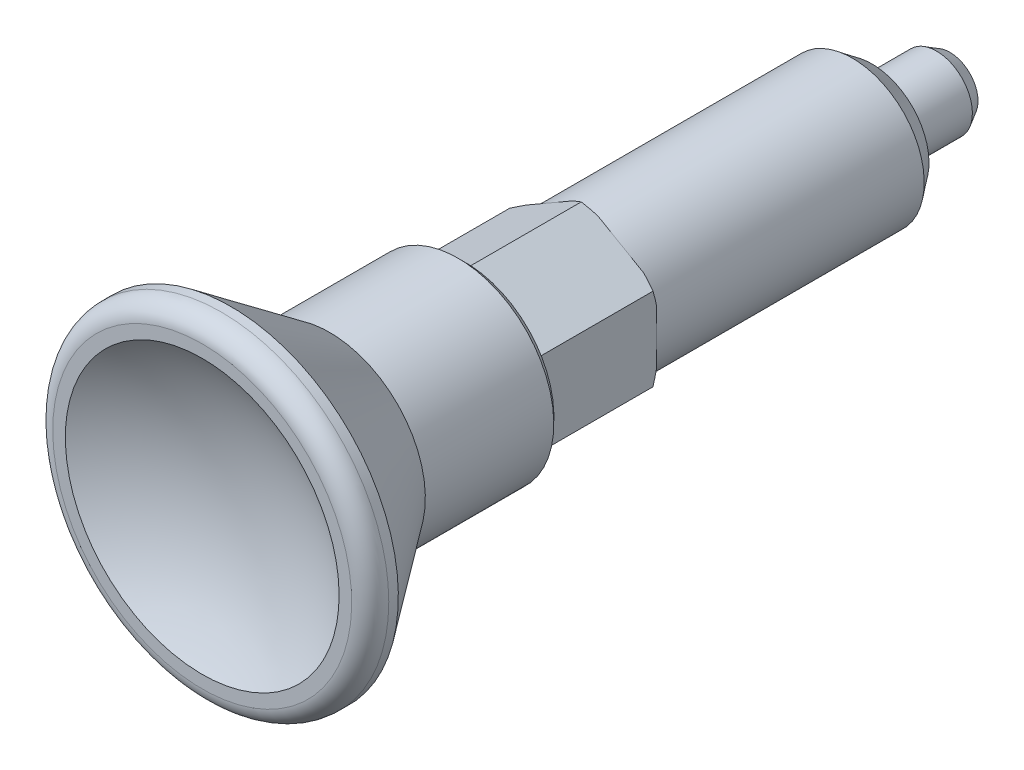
ISO-10303-21;
HEADER;
FILE_DESCRIPTION(('STEP AP214'),'2;1');
FILE_NAME('part.step','',(''),(''),'','','');
FILE_SCHEMA(('AUTOMOTIVE_DESIGN { 1 0 10303 214 1 1 1 1 }'));
ENDSEC;
DATA;
#1=APPLICATION_CONTEXT('core data for automotive mechanical design processes');
#2=APPLICATION_PROTOCOL_DEFINITION('international standard','automotive_design',2000,#1);
#3=PRODUCT_CONTEXT('',#1,'mechanical');
#4=PRODUCT('Part','Part','',(#3));
#5=PRODUCT_RELATED_PRODUCT_CATEGORY('part','',(#4));
#6=PRODUCT_DEFINITION_FORMATION('','',#4);
#7=PRODUCT_DEFINITION_CONTEXT('part definition',#1,'design');
#8=PRODUCT_DEFINITION('design','',#6,#7);
#9=PRODUCT_DEFINITION_SHAPE('','',#8);
#10=(LENGTH_UNIT() NAMED_UNIT(*) SI_UNIT(.MILLI.,.METRE.));
#11=(NAMED_UNIT(*) PLANE_ANGLE_UNIT() SI_UNIT($,.RADIAN.));
#12=(NAMED_UNIT(*) SI_UNIT($,.STERADIAN.) SOLID_ANGLE_UNIT());
#13=UNCERTAINTY_MEASURE_WITH_UNIT(LENGTH_MEASURE(1.E-05),#10,'distance_accuracy_value','');
#14=(GEOMETRIC_REPRESENTATION_CONTEXT(3) GLOBAL_UNCERTAINTY_ASSIGNED_CONTEXT((#13)) GLOBAL_UNIT_ASSIGNED_CONTEXT((#10,
#11,#12)) REPRESENTATION_CONTEXT('',''));
#15=CARTESIAN_POINT('',(0.,0.,0.));
#16=DIRECTION('',(0.,0.,1.));
#17=DIRECTION('',(1.,0.,0.));
#18=AXIS2_PLACEMENT_3D('',#15,#16,#17);
#19=CARTESIAN_POINT('',(3.,0.,0.));
#20=DIRECTION('',(0.,0.,-1.));
#21=DIRECTION('',(0.,1.,0.));
#22=AXIS2_PLACEMENT_3D('',#19,#20,#21);
#23=PLANE('',#22);
#24=CARTESIAN_POINT('',(0.,0.,4.5475775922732E-12));
#25=DIRECTION('',(0.,0.,1.));
#26=DIRECTION('',(0.,-1.,0.));
#27=AXIS2_PLACEMENT_3D('',#24,#25,#26);
#28=CIRCLE('',#27,3.19999999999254);
#29=CARTESIAN_POINT('',(2.46436507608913,2.04129977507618,6.49740677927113E-12));
#30=VERTEX_POINT('',#29);
#31=CARTESIAN_POINT('',(3.,1.11355287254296,4.22318430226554E-12));
#32=VERTEX_POINT('',#31);
#33=EDGE_CURVE('E156',#30,#32,#28,.F.);
#34=ORIENTED_EDGE('',*,*,#33,.T.);
#35=DIRECTION('',(0.,1.,0.));
#36=VECTOR('',#35,1.);
#37=CARTESIAN_POINT('',(3.,0.,0.));
#38=LINE('',#37,#36);
#39=CARTESIAN_POINT('',(3.,0.,0.));
#40=VERTEX_POINT('',#39);
#41=EDGE_CURVE('E162',#32,#40,#38,.F.);
#42=ORIENTED_EDGE('',*,*,#41,.T.);
#43=CARTESIAN_POINT('',(0.,0.,0.));
#44=DIRECTION('',(0.,0.,1.));
#45=DIRECTION('',(0.,-1.,0.));
#46=AXIS2_PLACEMENT_3D('',#43,#44,#45);
#47=CIRCLE('',#46,3.);
#48=CARTESIAN_POINT('',(1.5,2.59807621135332,0.));
#49=VERTEX_POINT('',#48);
#50=EDGE_CURVE('E332',#49,#40,#47,.F.);
#51=ORIENTED_EDGE('',*,*,#50,.F.);
#52=DIRECTION('',(0.866025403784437,-0.5,0.));
#53=VECTOR('',#52,1.);
#54=CARTESIAN_POINT('',(1.5,2.59807621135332,0.));
#55=LINE('',#54,#53);
#56=EDGE_CURVE('E181',#49,#30,#55,.T.);
#57=ORIENTED_EDGE('',*,*,#56,.T.);
#58=EDGE_LOOP('',(#34,#42,#51,#57));
#59=FACE_BOUND('',#58,.T.);
#60=ADVANCED_FACE('F14',(#59),#23,.T.);
#61=CARTESIAN_POINT('',(3.,0.,0.));
#62=DIRECTION('',(0.,0.,-1.));
#63=DIRECTION('',(0.,1.,0.));
#64=AXIS2_PLACEMENT_3D('',#61,#62,#63);
#65=PLANE('',#64);
#66=CARTESIAN_POINT('',(0.,0.,4.5475775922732E-12));
#67=DIRECTION('',(0.,0.,1.));
#68=DIRECTION('',(0.,-1.,0.));
#69=AXIS2_PLACEMENT_3D('',#66,#67,#68);
#70=CIRCLE('',#69,3.19999999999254);
#71=CARTESIAN_POINT('',(0.535634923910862,-3.15485264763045,6.49567205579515E-12));
#72=VERTEX_POINT('',#71);
#73=CARTESIAN_POINT('',(-0.535634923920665,-3.1548526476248,4.22318430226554E-12));
#74=VERTEX_POINT('',#73);
#75=EDGE_CURVE('E187',#72,#74,#70,.F.);
#76=ORIENTED_EDGE('',*,*,#75,.T.);
#77=DIRECTION('',(-0.86602540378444,0.5,0.));
#78=VECTOR('',#77,1.);
#79=CARTESIAN_POINT('',(-0.535634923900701,-3.15485264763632,0.));
#80=LINE('',#79,#78);
#81=CARTESIAN_POINT('',(-1.5,-2.59807621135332,0.));
#82=VERTEX_POINT('',#81);
#83=EDGE_CURVE('E351',#74,#82,#80,.T.);
#84=ORIENTED_EDGE('',*,*,#83,.T.);
#85=CARTESIAN_POINT('',(0.,0.,0.));
#86=DIRECTION('',(0.,0.,1.));
#87=DIRECTION('',(0.,-1.,0.));
#88=AXIS2_PLACEMENT_3D('',#85,#86,#87);
#89=CIRCLE('',#88,3.);
#90=CARTESIAN_POINT('',(1.5,-2.59807621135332,0.));
#91=VERTEX_POINT('',#90);
#92=EDGE_CURVE('E770',#91,#82,#89,.F.);
#93=ORIENTED_EDGE('',*,*,#92,.F.);
#94=DIRECTION('',(-0.86602540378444,-0.5,0.));
#95=VECTOR('',#94,1.);
#96=CARTESIAN_POINT('',(1.5,-2.59807621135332,0.));
#97=LINE('',#96,#95);
#98=EDGE_CURVE('E172',#91,#72,#97,.T.);
#99=ORIENTED_EDGE('',*,*,#98,.T.);
#100=EDGE_LOOP('',(#76,#84,#93,#99));
#101=FACE_BOUND('',#100,.T.);
#102=ADVANCED_FACE('F667',(#101),#65,.T.);
#103=CARTESIAN_POINT('',(3.,0.,0.));
#104=DIRECTION('',(0.,0.,-1.));
#105=DIRECTION('',(0.,1.,0.));
#106=AXIS2_PLACEMENT_3D('',#103,#104,#105);
#107=PLANE('',#106);
#108=CARTESIAN_POINT('',(0.,0.,0.));
#109=DIRECTION('',(0.,0.,1.));
#110=DIRECTION('',(0.,-1.,0.));
#111=AXIS2_PLACEMENT_3D('',#108,#109,#110);
#112=CIRCLE('',#111,3.);
#113=CARTESIAN_POINT('',(-3.,0.,0.));
#114=VERTEX_POINT('',#113);
#115=EDGE_CURVE('E767',#82,#114,#112,.F.);
#116=ORIENTED_EDGE('',*,*,#115,.F.);
#117=DIRECTION('',(-0.866025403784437,0.5,0.));
#118=VECTOR('',#117,1.);
#119=CARTESIAN_POINT('',(-1.5,-2.59807621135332,0.));
#120=LINE('',#119,#118);
#121=CARTESIAN_POINT('',(-2.46436507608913,-2.04129977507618,6.49740677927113E-12));
#122=VERTEX_POINT('',#121);
#123=EDGE_CURVE('E344',#82,#122,#120,.T.);
#124=ORIENTED_EDGE('',*,*,#123,.T.);
#125=CARTESIAN_POINT('',(0.,0.,4.5475775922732E-12));
#126=DIRECTION('',(0.,0.,1.));
#127=DIRECTION('',(0.,-1.,0.));
#128=AXIS2_PLACEMENT_3D('',#125,#126,#127);
#129=CIRCLE('',#128,3.19999999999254);
#130=CARTESIAN_POINT('',(-3.,-1.11355287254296,4.22318430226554E-12));
#131=VERTEX_POINT('',#130);
#132=EDGE_CURVE('E350',#122,#131,#129,.F.);
#133=ORIENTED_EDGE('',*,*,#132,.T.);
#134=DIRECTION('',(0.,1.,0.));
#135=VECTOR('',#134,1.);
#136=CARTESIAN_POINT('',(-3.,0.,0.));
#137=LINE('',#136,#135);
#138=EDGE_CURVE('E347',#131,#114,#137,.T.);
#139=ORIENTED_EDGE('',*,*,#138,.T.);
#140=EDGE_LOOP('',(#116,#124,#133,#139));
#141=FACE_BOUND('',#140,.T.);
#142=ADVANCED_FACE('F657',(#141),#107,.T.);
#143=CARTESIAN_POINT('',(3.,0.,0.));
#144=DIRECTION('',(0.,0.,-1.));
#145=DIRECTION('',(0.,1.,0.));
#146=AXIS2_PLACEMENT_3D('',#143,#144,#145);
#147=PLANE('',#146);
#148=CARTESIAN_POINT('',(0.,0.,4.5475775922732E-12));
#149=DIRECTION('',(0.,0.,1.));
#150=DIRECTION('',(0.,-1.,0.));
#151=AXIS2_PLACEMENT_3D('',#148,#149,#150);
#152=CIRCLE('',#151,3.19999999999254);
#153=CARTESIAN_POINT('',(-3.,1.11355287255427,6.49740677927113E-12));
#154=VERTEX_POINT('',#153);
#155=CARTESIAN_POINT('',(-2.46436507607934,2.04129977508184,4.22231694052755E-12));
#156=VERTEX_POINT('',#155);
#157=EDGE_CURVE('E340',#154,#156,#152,.F.);
#158=ORIENTED_EDGE('',*,*,#157,.T.);
#159=DIRECTION('',(0.866025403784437,0.5,0.));
#160=VECTOR('',#159,1.);
#161=CARTESIAN_POINT('',(-2.4643650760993,2.04129977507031,0.));
#162=LINE('',#161,#160);
#163=CARTESIAN_POINT('',(-1.5,2.59807621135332,0.));
#164=VERTEX_POINT('',#163);
#165=EDGE_CURVE('E337',#156,#164,#162,.T.);
#166=ORIENTED_EDGE('',*,*,#165,.T.);
#167=CARTESIAN_POINT('',(0.,0.,0.));
#168=DIRECTION('',(0.,0.,1.));
#169=DIRECTION('',(0.,-1.,0.));
#170=AXIS2_PLACEMENT_3D('',#167,#168,#169);
#171=CIRCLE('',#170,3.);
#172=EDGE_CURVE('E765',#114,#164,#171,.F.);
#173=ORIENTED_EDGE('',*,*,#172,.F.);
#174=DIRECTION('',(0.,1.,0.));
#175=VECTOR('',#174,1.);
#176=CARTESIAN_POINT('',(-3.,0.,0.));
#177=LINE('',#176,#175);
#178=EDGE_CURVE('E341',#114,#154,#177,.T.);
#179=ORIENTED_EDGE('',*,*,#178,.T.);
#180=EDGE_LOOP('',(#158,#166,#173,#179));
#181=FACE_BOUND('',#180,.T.);
#182=ADVANCED_FACE('F647',(#181),#147,.T.);
#183=CARTESIAN_POINT('',(3.,0.,0.));
#184=DIRECTION('',(0.,0.,-1.));
#185=DIRECTION('',(0.,1.,0.));
#186=AXIS2_PLACEMENT_3D('',#183,#184,#185);
#187=PLANE('',#186);
#188=CARTESIAN_POINT('',(0.,0.,4.5475775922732E-12));
#189=DIRECTION('',(0.,0.,1.));
#190=DIRECTION('',(0.,-1.,0.));
#191=AXIS2_PLACEMENT_3D('',#188,#189,#190);
#192=CIRCLE('',#191,3.19999999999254);
#193=CARTESIAN_POINT('',(-0.535634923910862,3.15485264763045,6.49567205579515E-12));
#194=VERTEX_POINT('',#193);
#195=CARTESIAN_POINT('',(0.535634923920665,3.1548526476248,4.22318430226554E-12));
#196=VERTEX_POINT('',#195);
#197=EDGE_CURVE('E333',#194,#196,#192,.F.);
#198=ORIENTED_EDGE('',*,*,#197,.T.);
#199=DIRECTION('',(0.86602540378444,-0.5,0.));
#200=VECTOR('',#199,1.);
#201=CARTESIAN_POINT('',(0.535634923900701,3.15485264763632,0.));
#202=LINE('',#201,#200);
#203=EDGE_CURVE('E329',#196,#49,#202,.T.);
#204=ORIENTED_EDGE('',*,*,#203,.T.);
#205=CARTESIAN_POINT('',(0.,0.,0.));
#206=DIRECTION('',(0.,0.,1.));
#207=DIRECTION('',(0.,-1.,0.));
#208=AXIS2_PLACEMENT_3D('',#205,#206,#207);
#209=CIRCLE('',#208,3.);
#210=EDGE_CURVE('E762',#164,#49,#209,.F.);
#211=ORIENTED_EDGE('',*,*,#210,.F.);
#212=DIRECTION('',(0.86602540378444,0.5,0.));
#213=VECTOR('',#212,1.);
#214=CARTESIAN_POINT('',(-1.5,2.59807621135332,0.));
#215=LINE('',#214,#213);
#216=EDGE_CURVE('E334',#164,#194,#215,.T.);
#217=ORIENTED_EDGE('',*,*,#216,.T.);
#218=EDGE_LOOP('',(#198,#204,#211,#217));
#219=FACE_BOUND('',#218,.T.);
#220=ADVANCED_FACE('F642',(#219),#187,.T.);
#221=CARTESIAN_POINT('',(0.,0.,-12.));
#222=DIRECTION('',(0.,0.,1.));
#223=DIRECTION('',(0.,-1.,0.));
#224=AXIS2_PLACEMENT_3D('',#221,#222,#223);
#225=CYLINDRICAL_SURFACE('',#224,3.);
#226=ORIENTED_EDGE('',*,*,#172,.T.);
#227=ORIENTED_EDGE('',*,*,#210,.T.);
#228=ORIENTED_EDGE('',*,*,#50,.T.);
#229=CARTESIAN_POINT('',(0.,0.,0.));
#230=DIRECTION('',(0.,0.,1.));
#231=DIRECTION('',(0.,-1.,0.));
#232=AXIS2_PLACEMENT_3D('',#229,#230,#231);
#233=CIRCLE('',#232,3.);
#234=EDGE_CURVE('E328',#91,#40,#233,.T.);
#235=ORIENTED_EDGE('',*,*,#234,.F.);
#236=ORIENTED_EDGE('',*,*,#92,.T.);
#237=ORIENTED_EDGE('',*,*,#115,.T.);
#238=EDGE_LOOP('',(#226,#227,#228,#235,#236,#237));
#239=FACE_BOUND('',#238,.T.);
#240=CARTESIAN_POINT('',(0.,0.,-11.1865));
#241=DIRECTION('',(0.,0.,1.));
#242=DIRECTION('',(0.,-1.,0.));
#243=AXIS2_PLACEMENT_3D('',#240,#241,#242);
#244=CIRCLE('',#243,3.);
#245=CARTESIAN_POINT('',(0.,-3.,-11.1865));
#246=VERTEX_POINT('',#245);
#247=EDGE_CURVE('E183',#246,#246,#244,.T.);
#248=ORIENTED_EDGE('',*,*,#247,.T.);
#249=EDGE_LOOP('',(#248));
#250=FACE_BOUND('',#249,.T.);
#251=ADVANCED_FACE('F358',(#239,#250),#225,.T.);
#252=CARTESIAN_POINT('',(3.,0.,0.));
#253=DIRECTION('',(0.,0.,-1.));
#254=DIRECTION('',(0.,1.,0.));
#255=AXIS2_PLACEMENT_3D('',#252,#253,#254);
#256=PLANE('',#255);
#257=CARTESIAN_POINT('',(0.,0.,4.5475775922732E-12));
#258=DIRECTION('',(0.,0.,1.));
#259=DIRECTION('',(0.,-1.,0.));
#260=AXIS2_PLACEMENT_3D('',#257,#258,#259);
#261=CIRCLE('',#260,3.19999999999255);
#262=CARTESIAN_POINT('',(2.46436507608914,-2.04129977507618,6.49567205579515E-12));
#263=VERTEX_POINT('',#262);
#264=CARTESIAN_POINT('',(3.,-1.11355287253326,2.2733551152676E-12));
#265=VERTEX_POINT('',#264);
#266=EDGE_CURVE('E327',#263,#265,#261,.T.);
#267=ORIENTED_EDGE('',*,*,#266,.F.);
#268=DIRECTION('',(0.866025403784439,0.5,0.));
#269=VECTOR('',#268,1.);
#270=CARTESIAN_POINT('',(0.,-3.46410161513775,0.));
#271=LINE('',#270,#269);
#272=EDGE_CURVE('E321',#91,#263,#271,.T.);
#273=ORIENTED_EDGE('',*,*,#272,.F.);
#274=ORIENTED_EDGE('',*,*,#234,.T.);
#275=DIRECTION('',(0.,1.,0.));
#276=VECTOR('',#275,1.);
#277=CARTESIAN_POINT('',(3.,0.,0.));
#278=LINE('',#277,#276);
#279=EDGE_CURVE('E167',#40,#265,#278,.F.);
#280=ORIENTED_EDGE('',*,*,#279,.T.);
#281=EDGE_LOOP('',(#267,#273,#274,#280));
#282=FACE_BOUND('',#281,.T.);
#283=ADVANCED_FACE('F625',(#282),#256,.T.);
#284=CARTESIAN_POINT('',(0.,0.,0.153394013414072));
#285=DIRECTION('',(0.,0.,1.));
#286=DIRECTION('',(0.,-1.,0.));
#287=AXIS2_PLACEMENT_3D('',#284,#285,#286);
#288=CONICAL_SURFACE('',#287,3.46568622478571,1.04719755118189);
#289=CARTESIAN_POINT('',(3.23529037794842E-12,-3.46410161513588,0.152479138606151));
#290=CARTESIAN_POINT('',(0.0441893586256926,-3.43858887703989,0.137749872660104));
#291=CARTESIAN_POINT('',(0.0884924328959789,-3.41301048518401,0.12346983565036));
#292=CARTESIAN_POINT('',(0.177307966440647,-3.36173281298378,0.0958975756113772));
#293=CARTESIAN_POINT('',(0.221820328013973,-3.33603358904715,0.0826049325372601));
#294=CARTESIAN_POINT('',(0.311076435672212,-3.28450155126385,0.0570834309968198));
#295=CARTESIAN_POINT('',(0.355820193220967,-3.25866873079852,0.0448546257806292));
#296=CARTESIAN_POINT('',(0.445551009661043,-3.20686261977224,0.021543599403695));
#297=CARTESIAN_POINT('',(0.490538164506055,-3.18088927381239,0.0104618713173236));
#298=CARTESIAN_POINT('',(0.535634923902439,-3.15485264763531,8.3622345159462E-12));
#299=B_SPLINE_CURVE_WITH_KNOTS('',3,(#289,#290,#291,#292,#293,#294,#295,#296,#297,#298),
.UNSPECIFIED.,.F.,.F.,(4,2,2,2,4),(0.,0.159326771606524,0.318585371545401,0.477851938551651,
0.637186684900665),.UNSPECIFIED.);
#300=CARTESIAN_POINT('',(1.61634413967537E-12,-3.46410161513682,0.152479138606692));
#301=VERTEX_POINT('',#300);
#302=EDGE_CURVE('E325',#301,#72,#299,.T.);
#303=ORIENTED_EDGE('',*,*,#302,.F.);
#304=CARTESIAN_POINT('',(-0.535634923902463,-3.15485264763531,8.44636860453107E-12));
#305=CARTESIAN_POINT('',(-0.490538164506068,-3.18088927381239,0.0104618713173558));
#306=CARTESIAN_POINT('',(-0.445551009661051,-3.20686261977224,0.0215435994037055));
#307=CARTESIAN_POINT('',(-0.355820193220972,-3.25866873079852,0.0448546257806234));
#308=CARTESIAN_POINT('',(-0.311076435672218,-3.28450155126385,0.0570834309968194));
#309=CARTESIAN_POINT('',(-0.221820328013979,-3.33603358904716,0.0826049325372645));
#310=CARTESIAN_POINT('',(-0.177307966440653,-3.36173281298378,0.095897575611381));
#311=CARTESIAN_POINT('',(-0.0884924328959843,-3.41301048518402,0.123469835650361));
#312=CARTESIAN_POINT('',(-0.0441893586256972,-3.43858887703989,0.137749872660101));
#313=CARTESIAN_POINT('',(-3.23940384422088E-12,-3.46410161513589,0.152479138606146));
#314=B_SPLINE_CURVE_WITH_KNOTS('',3,(#304,#305,#306,#307,#308,#309,#310,#311,#312,#313),
.UNSPECIFIED.,.F.,.F.,(4,2,2,2,4),(0.,0.159334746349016,0.318601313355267,0.477859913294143,
0.637186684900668),.UNSPECIFIED.);
#315=EDGE_CURVE('E707',#74,#301,#314,.T.);
#316=ORIENTED_EDGE('',*,*,#315,.F.);
#317=ORIENTED_EDGE('',*,*,#75,.F.);
#318=EDGE_LOOP('',(#303,#316,#317));
#319=FACE_BOUND('',#318,.T.);
#320=ADVANCED_FACE('F615',(#319),#288,.T.);
#321=CARTESIAN_POINT('',(0.,0.,0.153394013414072));
#322=DIRECTION('',(0.,0.,1.));
#323=DIRECTION('',(0.,-1.,0.));
#324=AXIS2_PLACEMENT_3D('',#321,#322,#323);
#325=CONICAL_SURFACE('',#324,3.46568622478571,1.04719755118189);
#326=CARTESIAN_POINT('',(-3.,-1.11355287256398,8.44550124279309E-12));
#327=CARTESIAN_POINT('',(-3.,-1.16562612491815,0.0104618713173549));
#328=CARTESIAN_POINT('',(-3.,-1.21757281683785,0.0215435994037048));
#329=CARTESIAN_POINT('',(-3.,-1.32118503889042,0.0448546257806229));
#330=CARTESIAN_POINT('',(-3.,-1.37285067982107,0.0570834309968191));
#331=CARTESIAN_POINT('',(-3.,-1.47591475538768,0.0826049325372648));
#332=CARTESIAN_POINT('',(-3.,-1.52731320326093,0.0958975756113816));
#333=CARTESIAN_POINT('',(-3.,-1.6298685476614,0.123469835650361));
#334=CARTESIAN_POINT('',(-3.,-1.68102533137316,0.137749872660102));
#335=CARTESIAN_POINT('',(-3.,-1.73205080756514,0.152479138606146));
#336=B_SPLINE_CURVE_WITH_KNOTS('',3,(#326,#327,#328,#329,#330,#331,#332,#333,#334,#335),
.UNSPECIFIED.,.F.,.F.,(4,2,2,2,4),(0.,0.159334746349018,0.31860131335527,0.477859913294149,
0.637186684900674),.UNSPECIFIED.);
#337=CARTESIAN_POINT('',(-2.99999999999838,-1.73205080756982,0.152479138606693));
#338=VERTEX_POINT('',#337);
#339=EDGE_CURVE('E784',#131,#338,#336,.T.);
#340=ORIENTED_EDGE('',*,*,#339,.F.);
#341=ORIENTED_EDGE('',*,*,#132,.F.);
#342=CARTESIAN_POINT('',(-2.99999999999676,-1.73205080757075,0.152479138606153));
#343=CARTESIAN_POINT('',(-2.9558106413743,-1.75756354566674,0.137749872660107));
#344=CARTESIAN_POINT('',(-2.91150756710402,-1.78314193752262,0.123469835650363));
#345=CARTESIAN_POINT('',(-2.82269203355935,-1.83441960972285,0.0958975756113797));
#346=CARTESIAN_POINT('',(-2.77817967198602,-1.86011883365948,0.0826049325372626));
#347=CARTESIAN_POINT('',(-2.68892356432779,-1.91165087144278,0.0570834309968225));
#348=CARTESIAN_POINT('',(-2.64417980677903,-1.93748369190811,0.0448546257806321));
#349=CARTESIAN_POINT('',(-2.55444899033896,-1.98928980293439,0.0215435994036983));
#350=CARTESIAN_POINT('',(-2.50946183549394,-2.01526314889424,0.010461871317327));
#351=CARTESIAN_POINT('',(-2.46436507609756,-2.04129977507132,8.36570396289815E-12));
#352=B_SPLINE_CURVE_WITH_KNOTS('',3,(#342,#343,#344,#345,#346,#347,#348,#349,#350,#351),
.UNSPECIFIED.,.F.,.F.,(4,2,2,2,4),(0.,0.159326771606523,0.318585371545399,0.477851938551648,
0.637186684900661),.UNSPECIFIED.);
#353=EDGE_CURVE('E715',#338,#122,#352,.T.);
#354=ORIENTED_EDGE('',*,*,#353,.F.);
#355=EDGE_LOOP('',(#340,#341,#354));
#356=FACE_BOUND('',#355,.T.);
#357=ADVANCED_FACE('F605',(#356),#325,.T.);
#358=CARTESIAN_POINT('',(0.,0.,0.153394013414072));
#359=DIRECTION('',(0.,0.,1.));
#360=DIRECTION('',(0.,-1.,0.));
#361=AXIS2_PLACEMENT_3D('',#358,#359,#360);
#362=CONICAL_SURFACE('',#361,3.46568622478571,1.04719755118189);
#363=CARTESIAN_POINT('',(-3.,1.73205080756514,0.152479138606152));
#364=CARTESIAN_POINT('',(-3.,1.68102533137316,0.137749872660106));
#365=CARTESIAN_POINT('',(-3.,1.6298685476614,0.123469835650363));
#366=CARTESIAN_POINT('',(-3.,1.52731320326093,0.0958975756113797));
#367=CARTESIAN_POINT('',(-3.,1.47591475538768,0.0826049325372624));
#368=CARTESIAN_POINT('',(-3.,1.37285067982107,0.057083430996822));
#369=CARTESIAN_POINT('',(-3.,1.32118503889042,0.0448546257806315));
#370=CARTESIAN_POINT('',(-3.,1.21757281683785,0.0215435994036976));
#371=CARTESIAN_POINT('',(-3.,1.16562612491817,0.0104618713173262));
#372=CARTESIAN_POINT('',(-3.,1.113552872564,8.36483660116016E-12));
#373=B_SPLINE_CURVE_WITH_KNOTS('',3,(#363,#364,#365,#366,#367,#368,#369,#370,#371,#372),
.UNSPECIFIED.,.F.,.F.,(4,2,2,2,4),(0.,0.159326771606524,0.318585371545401,0.47785193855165,
0.637186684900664),.UNSPECIFIED.);
#374=CARTESIAN_POINT('',(-3.,1.732050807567,0.152479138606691));
#375=VERTEX_POINT('',#374);
#376=EDGE_CURVE('E788',#375,#154,#373,.T.);
#377=ORIENTED_EDGE('',*,*,#376,.F.);
#378=CARTESIAN_POINT('',(-2.46436507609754,2.04129977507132,8.4446338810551E-12));
#379=CARTESIAN_POINT('',(-2.50946183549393,2.01526314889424,0.0104618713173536));
#380=CARTESIAN_POINT('',(-2.55444899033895,1.98928980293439,0.0215435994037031));
#381=CARTESIAN_POINT('',(-2.64417980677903,1.9374836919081,0.0448546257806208));
#382=CARTESIAN_POINT('',(-2.68892356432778,1.91165087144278,0.0570834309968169));
#383=CARTESIAN_POINT('',(-2.77817967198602,1.86011883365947,0.0826049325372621));
#384=CARTESIAN_POINT('',(-2.82269203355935,1.83441960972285,0.0958975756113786));
#385=CARTESIAN_POINT('',(-2.91150756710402,1.78314193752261,0.123469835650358));
#386=CARTESIAN_POINT('',(-2.9558106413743,1.75756354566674,0.137749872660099));
#387=CARTESIAN_POINT('',(-2.99999999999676,1.73205080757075,0.152479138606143));
#388=B_SPLINE_CURVE_WITH_KNOTS('',3,(#378,#379,#380,#381,#382,#383,#384,#385,#386,#387),
.UNSPECIFIED.,.F.,.F.,(4,2,2,2,4),(0.,0.159334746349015,0.318601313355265,0.47785991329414,
0.637186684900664),.UNSPECIFIED.);
#389=EDGE_CURVE('E896',#156,#375,#388,.T.);
#390=ORIENTED_EDGE('',*,*,#389,.F.);
#391=ORIENTED_EDGE('',*,*,#157,.F.);
#392=EDGE_LOOP('',(#377,#390,#391));
#393=FACE_BOUND('',#392,.T.);
#394=ADVANCED_FACE('F595',(#393),#362,.T.);
#395=CARTESIAN_POINT('',(0.,0.,0.153394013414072));
#396=DIRECTION('',(0.,0.,1.));
#397=DIRECTION('',(0.,-1.,0.));
#398=AXIS2_PLACEMENT_3D('',#395,#396,#397);
#399=CONICAL_SURFACE('',#398,3.46568622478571,1.04719755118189);
#400=CARTESIAN_POINT('',(-3.23507737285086E-12,3.46410161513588,0.152479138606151));
#401=CARTESIAN_POINT('',(-0.0441893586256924,3.43858887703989,0.137749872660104));
#402=CARTESIAN_POINT('',(-0.0884924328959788,3.41301048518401,0.12346983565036));
#403=CARTESIAN_POINT('',(-0.177307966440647,3.36173281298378,0.0958975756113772));
#404=CARTESIAN_POINT('',(-0.221820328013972,3.33603358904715,0.0826049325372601));
#405=CARTESIAN_POINT('',(-0.311076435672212,3.28450155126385,0.0570834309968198));
#406=CARTESIAN_POINT('',(-0.355820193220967,3.25866873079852,0.0448546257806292));
#407=CARTESIAN_POINT('',(-0.445551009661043,3.20686261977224,0.021543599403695));
#408=CARTESIAN_POINT('',(-0.490538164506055,3.18088927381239,0.0104618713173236));
#409=CARTESIAN_POINT('',(-0.535634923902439,3.15485264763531,8.3622345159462E-12));
#410=B_SPLINE_CURVE_WITH_KNOTS('',3,(#400,#401,#402,#403,#404,#405,#406,#407,#408,#409),
.UNSPECIFIED.,.F.,.F.,(4,2,2,2,4),(0.,0.159326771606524,0.318585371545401,0.477851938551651,
0.637186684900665),.UNSPECIFIED.);
#411=CARTESIAN_POINT('',(-1.61623763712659E-12,3.46410161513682,0.152479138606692));
#412=VERTEX_POINT('',#411);
#413=EDGE_CURVE('E894',#412,#194,#410,.T.);
#414=ORIENTED_EDGE('',*,*,#413,.F.);
#415=CARTESIAN_POINT('',(0.535634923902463,3.15485264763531,8.44723596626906E-12));
#416=CARTESIAN_POINT('',(0.490538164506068,3.18088927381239,0.0104618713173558));
#417=CARTESIAN_POINT('',(0.445551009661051,3.20686261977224,0.0215435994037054));
#418=CARTESIAN_POINT('',(0.355820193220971,3.25866873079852,0.0448546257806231));
#419=CARTESIAN_POINT('',(0.311076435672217,3.28450155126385,0.0570834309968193));
#420=CARTESIAN_POINT('',(0.221820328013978,3.33603358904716,0.0826049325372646));
#421=CARTESIAN_POINT('',(0.177307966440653,3.36173281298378,0.0958975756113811));
#422=CARTESIAN_POINT('',(0.0884924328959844,3.41301048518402,0.123469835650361));
#423=CARTESIAN_POINT('',(0.0441893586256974,3.43858887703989,0.137749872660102));
#424=CARTESIAN_POINT('',(3.23948435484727E-12,3.46410161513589,0.152479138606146));
#425=B_SPLINE_CURVE_WITH_KNOTS('',3,(#415,#416,#417,#418,#419,#420,#421,#422,#423,#424),
.UNSPECIFIED.,.F.,.F.,(4,2,2,2,4),(0.,0.159334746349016,0.318601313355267,0.477859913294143,
0.637186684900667),.UNSPECIFIED.);
#426=EDGE_CURVE('E849',#196,#412,#425,.T.);
#427=ORIENTED_EDGE('',*,*,#426,.F.);
#428=ORIENTED_EDGE('',*,*,#197,.F.);
#429=EDGE_LOOP('',(#414,#427,#428));
#430=FACE_BOUND('',#429,.T.);
#431=ADVANCED_FACE('F585',(#430),#399,.T.);
#432=CARTESIAN_POINT('',(0.,0.,0.153394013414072));
#433=DIRECTION('',(0.,0.,1.));
#434=DIRECTION('',(0.,-1.,0.));
#435=AXIS2_PLACEMENT_3D('',#432,#433,#434);
#436=CONICAL_SURFACE('',#435,3.46568622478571,1.04719755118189);
#437=CARTESIAN_POINT('',(3.,-1.73205080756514,0.152479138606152));
#438=CARTESIAN_POINT('',(3.,-1.68102533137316,0.137749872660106));
#439=CARTESIAN_POINT('',(3.,-1.6298685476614,0.123469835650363));
#440=CARTESIAN_POINT('',(3.,-1.52731320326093,0.0958975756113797));
#441=CARTESIAN_POINT('',(3.,-1.47591475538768,0.0826049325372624));
#442=CARTESIAN_POINT('',(3.,-1.37285067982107,0.057083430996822));
#443=CARTESIAN_POINT('',(3.,-1.32118503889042,0.0448546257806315));
#444=CARTESIAN_POINT('',(3.,-1.21757281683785,0.0215435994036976));
#445=CARTESIAN_POINT('',(3.,-1.16562612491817,0.0104618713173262));
#446=CARTESIAN_POINT('',(3.,-1.113552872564,8.36483660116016E-12));
#447=B_SPLINE_CURVE_WITH_KNOTS('',3,(#437,#438,#439,#440,#441,#442,#443,#444,#445,#446),
.UNSPECIFIED.,.F.,.F.,(4,2,2,2,4),(0.,0.159326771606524,0.318585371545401,0.47785193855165,
0.637186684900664),.UNSPECIFIED.);
#448=CARTESIAN_POINT('',(2.99999999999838,-1.73205080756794,0.152479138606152));
#449=VERTEX_POINT('',#448);
#450=EDGE_CURVE('E178',#449,#265,#447,.T.);
#451=ORIENTED_EDGE('',*,*,#450,.F.);
#452=CARTESIAN_POINT('',(2.46436507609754,-2.04129977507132,8.4446338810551E-12));
#453=CARTESIAN_POINT('',(2.50946183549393,-2.01526314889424,0.0104618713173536));
#454=CARTESIAN_POINT('',(2.55444899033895,-1.98928980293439,0.0215435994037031));
#455=CARTESIAN_POINT('',(2.64417980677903,-1.9374836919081,0.0448546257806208));
#456=CARTESIAN_POINT('',(2.68892356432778,-1.91165087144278,0.0570834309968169));
#457=CARTESIAN_POINT('',(2.77817967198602,-1.86011883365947,0.0826049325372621));
#458=CARTESIAN_POINT('',(2.82269203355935,-1.83441960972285,0.0958975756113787));
#459=CARTESIAN_POINT('',(2.91150756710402,-1.78314193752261,0.123469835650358));
#460=CARTESIAN_POINT('',(2.9558106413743,-1.75756354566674,0.137749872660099));
#461=CARTESIAN_POINT('',(2.99999999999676,-1.73205080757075,0.152479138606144));
#462=B_SPLINE_CURVE_WITH_KNOTS('',3,(#452,#453,#454,#455,#456,#457,#458,#459,#460,#461),
.UNSPECIFIED.,.F.,.F.,(4,2,2,2,4),(0.,0.159334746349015,0.318601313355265,0.477859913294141,
0.637186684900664),.UNSPECIFIED.);
#463=EDGE_CURVE('E324',#263,#449,#462,.T.);
#464=ORIENTED_EDGE('',*,*,#463,.F.);
#465=ORIENTED_EDGE('',*,*,#266,.T.);
#466=EDGE_LOOP('',(#451,#464,#465));
#467=FACE_BOUND('',#466,.T.);
#468=ADVANCED_FACE('F576',(#467),#436,.T.);
#469=CARTESIAN_POINT('',(0.,0.,0.153394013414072));
#470=DIRECTION('',(0.,0.,1.));
#471=DIRECTION('',(0.,-1.,0.));
#472=AXIS2_PLACEMENT_3D('',#469,#470,#471);
#473=CONICAL_SURFACE('',#472,3.46568622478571,1.04719755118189);
#474=CARTESIAN_POINT('',(2.99999999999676,1.73205080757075,0.152479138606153));
#475=CARTESIAN_POINT('',(2.9558106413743,1.75756354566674,0.137749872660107));
#476=CARTESIAN_POINT('',(2.91150756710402,1.78314193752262,0.123469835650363));
#477=CARTESIAN_POINT('',(2.82269203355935,1.83441960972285,0.0958975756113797));
#478=CARTESIAN_POINT('',(2.77817967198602,1.86011883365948,0.0826049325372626));
#479=CARTESIAN_POINT('',(2.68892356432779,1.91165087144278,0.0570834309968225));
#480=CARTESIAN_POINT('',(2.64417980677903,1.93748369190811,0.0448546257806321));
#481=CARTESIAN_POINT('',(2.55444899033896,1.98928980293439,0.0215435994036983));
#482=CARTESIAN_POINT('',(2.50946183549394,2.01526314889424,0.010461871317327));
#483=CARTESIAN_POINT('',(2.46436507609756,2.04129977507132,8.36570396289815E-12));
#484=B_SPLINE_CURVE_WITH_KNOTS('',3,(#474,#475,#476,#477,#478,#479,#480,#481,#482,#483),
.UNSPECIFIED.,.F.,.F.,(4,2,2,2,4),(0.,0.159326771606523,0.318585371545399,0.477851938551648,
0.637186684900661),.UNSPECIFIED.);
#485=CARTESIAN_POINT('',(2.99999999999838,1.73205080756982,0.152479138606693));
#486=VERTEX_POINT('',#485);
#487=EDGE_CURVE('E175',#486,#30,#484,.T.);
#488=ORIENTED_EDGE('',*,*,#487,.F.);
#489=CARTESIAN_POINT('',(3.,1.11355287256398,8.44550124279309E-12));
#490=CARTESIAN_POINT('',(3.,1.16562612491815,0.0104618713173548));
#491=CARTESIAN_POINT('',(3.,1.21757281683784,0.0215435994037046));
#492=CARTESIAN_POINT('',(3.,1.32118503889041,0.0448546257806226));
#493=CARTESIAN_POINT('',(3.,1.37285067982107,0.0570834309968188));
#494=CARTESIAN_POINT('',(3.,1.47591475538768,0.0826049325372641));
#495=CARTESIAN_POINT('',(3.,1.52731320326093,0.0958975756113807));
#496=CARTESIAN_POINT('',(3.,1.6298685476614,0.12346983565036));
#497=CARTESIAN_POINT('',(3.,1.68102533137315,0.137749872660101));
#498=CARTESIAN_POINT('',(3.,1.73205080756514,0.152479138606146));
#499=B_SPLINE_CURVE_WITH_KNOTS('',3,(#489,#490,#491,#492,#493,#494,#495,#496,#497,#498),
.UNSPECIFIED.,.F.,.F.,(4,2,2,2,4),(0.,0.159334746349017,0.318601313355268,0.477859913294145,
0.637186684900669),.UNSPECIFIED.);
#500=EDGE_CURVE('E165',#32,#486,#499,.T.);
#501=ORIENTED_EDGE('',*,*,#500,.F.);
#502=ORIENTED_EDGE('',*,*,#33,.F.);
#503=EDGE_LOOP('',(#488,#501,#502));
#504=FACE_BOUND('',#503,.T.);
#505=ADVANCED_FACE('F174',(#504),#473,.T.);
#506=CARTESIAN_POINT('',(0.,0.,4.87610847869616));
#507=DIRECTION('',(0.,0.,-1.));
#508=DIRECTION('',(0.,1.,0.));
#509=AXIS2_PLACEMENT_3D('',#506,#507,#508);
#510=CONICAL_SURFACE('',#509,3.46568622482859,1.13446401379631);
#511=CARTESIAN_POINT('',(3.,-1.11355287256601,5.));
#512=CARTESIAN_POINT('',(3.,-1.16544691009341,4.99157943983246));
#513=CARTESIAN_POINT('',(3.,-1.2172578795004,4.98265459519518));
#514=CARTESIAN_POINT('',(3.,-1.32069358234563,4.96386415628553));
#515=CARTESIAN_POINT('',(3.,-1.3723183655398,4.95399883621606));
#516=CARTESIAN_POINT('',(3.,-1.47539005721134,4.93339063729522));
#517=CARTESIAN_POINT('',(3.,-1.52683697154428,4.92264778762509));
#518=CARTESIAN_POINT('',(3.,-1.62956909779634,4.90034446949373));
#519=CARTESIAN_POINT('',(3.,-1.68085425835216,4.88878376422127));
#520=CARTESIAN_POINT('',(3.,-1.73205080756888,4.87684739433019));
#521=B_SPLINE_CURVE_WITH_KNOTS('',3,(#511,#512,#513,#514,#515,#516,#517,#518,#519,#520),
.UNSPECIFIED.,.F.,.F.,(4,2,2,2,4),(0.,0.157714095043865,0.315382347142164,0.473045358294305,
0.630754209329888),.UNSPECIFIED.);
#522=CARTESIAN_POINT('',(3.,-1.11355287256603,5.));
#523=VERTEX_POINT('',#522);
#524=CARTESIAN_POINT('',(3.,-1.73205080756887,4.87684739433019));
#525=VERTEX_POINT('',#524);
#526=EDGE_CURVE('E296',#523,#525,#521,.T.);
#527=ORIENTED_EDGE('',*,*,#526,.F.);
#528=CARTESIAN_POINT('',(0.,0.,5.));
#529=DIRECTION('',(0.,0.,-1.));
#530=DIRECTION('',(0.,1.,0.));
#531=AXIS2_PLACEMENT_3D('',#528,#529,#530);
#532=CIRCLE('',#531,3.2);
#533=CARTESIAN_POINT('',(2.46436507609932,-2.0412997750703,5.));
#534=VERTEX_POINT('',#533);
#535=EDGE_CURVE('E177',#523,#534,#532,.T.);
#536=ORIENTED_EDGE('',*,*,#535,.T.);
#537=CARTESIAN_POINT('',(3.,-1.73205080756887,4.87684739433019));
#538=CARTESIAN_POINT('',(2.95566248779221,-1.75764908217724,4.88878376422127));
#539=CARTESIAN_POINT('',(2.91124823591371,-1.78329166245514,4.90034446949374));
#540=CARTESIAN_POINT('',(2.82227960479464,-1.83465772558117,4.92264778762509));
#541=CARTESIAN_POINT('',(2.77772527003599,-1.86038118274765,4.93339063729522));
#542=CARTESIAN_POINT('',(2.6884625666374,-1.91191702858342,4.95399883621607));
#543=CARTESIAN_POINT('',(2.64375419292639,-1.9377294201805,4.96386415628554));
#544=CARTESIAN_POINT('',(2.55417624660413,-1.98944727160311,4.98265459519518));
#545=CARTESIAN_POINT('',(2.50930663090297,-2.01535275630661,4.99157943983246));
#546=CARTESIAN_POINT('',(2.46436507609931,-2.0412997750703,5.));
#547=B_SPLINE_CURVE_WITH_KNOTS('',3,(#537,#538,#539,#540,#541,#542,#543,#544,#545,#546),
.UNSPECIFIED.,.F.,.F.,(4,2,2,2,4),(0.,0.157708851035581,0.31537186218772,0.473040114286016,
0.630754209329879),.UNSPECIFIED.);
#548=EDGE_CURVE('E752',#525,#534,#547,.T.);
#549=ORIENTED_EDGE('',*,*,#548,.F.);
#550=EDGE_LOOP('',(#527,#536,#549));
#551=FACE_BOUND('',#550,.T.);
#552=ADVANCED_FACE('F557',(#551),#510,.T.);
#553=CARTESIAN_POINT('',(0.,-3.46410161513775,0.));
#554=DIRECTION('',(0.5,-0.866025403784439,0.));
#555=DIRECTION('',(0.866025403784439,0.5,0.));
#556=AXIS2_PLACEMENT_3D('',#553,#554,#555);
#557=PLANE('',#556);
#558=ORIENTED_EDGE('',*,*,#272,.T.);
#559=ORIENTED_EDGE('',*,*,#463,.T.);
#560=DIRECTION('',(0.,0.,1.));
#561=VECTOR('',#560,1.);
#562=CARTESIAN_POINT('',(3.,-1.73205080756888,0.));
#563=LINE('',#562,#561);
#564=EDGE_CURVE('E293',#525,#449,#563,.F.);
#565=ORIENTED_EDGE('',*,*,#564,.F.);
#566=ORIENTED_EDGE('',*,*,#548,.T.);
#567=DIRECTION('',(-0.866025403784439,-0.5,0.));
#568=VECTOR('',#567,1.);
#569=CARTESIAN_POINT('',(2.4643650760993,-2.04129977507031,5.));
#570=LINE('',#569,#568);
#571=CARTESIAN_POINT('',(0.535634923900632,-3.15485264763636,5.));
#572=VERTEX_POINT('',#571);
#573=EDGE_CURVE('E290',#534,#572,#570,.T.);
#574=ORIENTED_EDGE('',*,*,#573,.T.);
#575=CARTESIAN_POINT('',(0.,-3.46410161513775,4.87684739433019));
#576=CARTESIAN_POINT('',(0.0443375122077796,-3.43850334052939,4.88878376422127));
#577=CARTESIAN_POINT('',(0.0887517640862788,-3.41286076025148,4.90034446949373));
#578=CARTESIAN_POINT('',(0.177720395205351,-3.36149469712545,4.92264778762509));
#579=CARTESIAN_POINT('',(0.222274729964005,-3.33577123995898,4.93339063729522));
#580=CARTESIAN_POINT('',(0.311537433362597,-3.28423539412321,4.95399883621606));
#581=CARTESIAN_POINT('',(0.356245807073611,-3.25842300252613,4.96386415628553));
#582=CARTESIAN_POINT('',(0.445823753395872,-3.20670515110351,4.98265459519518));
#583=CARTESIAN_POINT('',(0.490693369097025,-3.18079966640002,4.99157943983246));
#584=CARTESIAN_POINT('',(0.535634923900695,-3.15485264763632,5.));
#585=B_SPLINE_CURVE_WITH_KNOTS('',3,(#575,#576,#577,#578,#579,#580,#581,#582,#583,#584),
.UNSPECIFIED.,.F.,.F.,(4,2,2,2,4),(0.,0.157708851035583,0.315371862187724,0.473040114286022,
0.630754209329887),.UNSPECIFIED.);
#586=CARTESIAN_POINT('',(0.,-3.46410161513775,4.87684739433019));
#587=VERTEX_POINT('',#586);
#588=EDGE_CURVE('E320',#587,#572,#585,.T.);
#589=ORIENTED_EDGE('',*,*,#588,.F.);
#590=DIRECTION('',(0.,0.,1.));
#591=VECTOR('',#590,1.);
#592=CARTESIAN_POINT('',(0.,-3.46410161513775,0.));
#593=LINE('',#592,#591);
#594=EDGE_CURVE('E316',#301,#587,#593,.T.);
#595=ORIENTED_EDGE('',*,*,#594,.F.);
#596=ORIENTED_EDGE('',*,*,#302,.T.);
#597=ORIENTED_EDGE('',*,*,#98,.F.);
#598=EDGE_LOOP('',(#558,#559,#565,#566,#574,#589,#595,#596,#597));
#599=FACE_BOUND('',#598,.T.);
#600=ADVANCED_FACE('F547',(#599),#557,.T.);
#601=CARTESIAN_POINT('',(0.,0.,4.87610847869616));
#602=DIRECTION('',(0.,0.,-1.));
#603=DIRECTION('',(0.,1.,0.));
#604=AXIS2_PLACEMENT_3D('',#601,#602,#603);
#605=CONICAL_SURFACE('',#604,3.46568622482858,1.13446401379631);
#606=ORIENTED_EDGE('',*,*,#588,.T.);
#607=CARTESIAN_POINT('',(0.,0.,5.));
#608=DIRECTION('',(0.,0.,-1.));
#609=DIRECTION('',(0.,1.,0.));
#610=AXIS2_PLACEMENT_3D('',#607,#608,#609);
#611=CIRCLE('',#610,3.2);
#612=CARTESIAN_POINT('',(-0.53563492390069,-3.15485264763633,5.));
#613=VERTEX_POINT('',#612);
#614=EDGE_CURVE('E289',#572,#613,#611,.T.);
#615=ORIENTED_EDGE('',*,*,#614,.T.);
#616=CARTESIAN_POINT('',(0.,-3.46410161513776,4.87684739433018));
#617=CARTESIAN_POINT('',(-0.0443375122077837,-3.4385033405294,4.88878376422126));
#618=CARTESIAN_POINT('',(-0.0887517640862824,-3.41286076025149,4.90034446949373));
#619=CARTESIAN_POINT('',(-0.177720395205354,-3.36149469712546,4.92264778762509));
#620=CARTESIAN_POINT('',(-0.222274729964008,-3.33577123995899,4.93339063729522));
#621=CARTESIAN_POINT('',(-0.3115374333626,-3.28423539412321,4.95399883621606));
#622=CARTESIAN_POINT('',(-0.356245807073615,-3.25842300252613,4.96386415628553));
#623=CARTESIAN_POINT('',(-0.445823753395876,-3.20670515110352,4.98265459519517));
#624=CARTESIAN_POINT('',(-0.490693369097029,-3.18079966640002,4.99157943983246));
#625=CARTESIAN_POINT('',(-0.535634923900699,-3.15485264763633,5.));
#626=B_SPLINE_CURVE_WITH_KNOTS('',3,(#616,#617,#618,#619,#620,#621,#622,#623,#624,#625),
.UNSPECIFIED.,.F.,.F.,(4,2,2,2,4),(0.,0.157708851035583,0.315371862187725,0.473040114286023,
0.630754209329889),.UNSPECIFIED.);
#627=EDGE_CURVE('E319',#587,#613,#626,.T.);
#628=ORIENTED_EDGE('',*,*,#627,.F.);
#629=EDGE_LOOP('',(#606,#615,#628));
#630=FACE_BOUND('',#629,.T.);
#631=ADVANCED_FACE('F537',(#630),#605,.T.);
#632=CARTESIAN_POINT('',(-3.,-1.73205080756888,0.));
#633=DIRECTION('',(-0.5,-0.866025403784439,0.));
#634=DIRECTION('',(0.866025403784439,-0.5,0.));
#635=AXIS2_PLACEMENT_3D('',#632,#633,#634);
#636=PLANE('',#635);
#637=ORIENTED_EDGE('',*,*,#83,.F.);
#638=ORIENTED_EDGE('',*,*,#315,.T.);
#639=ORIENTED_EDGE('',*,*,#594,.T.);
#640=ORIENTED_EDGE('',*,*,#627,.T.);
#641=DIRECTION('',(-0.866025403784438,0.5,0.));
#642=VECTOR('',#641,1.);
#643=CARTESIAN_POINT('',(-0.535634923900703,-3.15485264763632,5.));
#644=LINE('',#643,#642);
#645=CARTESIAN_POINT('',(-2.46436507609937,-2.04129977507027,5.));
#646=VERTEX_POINT('',#645);
#647=EDGE_CURVE('E287',#613,#646,#644,.T.);
#648=ORIENTED_EDGE('',*,*,#647,.T.);
#649=CARTESIAN_POINT('',(-3.,-1.73205080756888,4.87684739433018));
#650=CARTESIAN_POINT('',(-2.95566248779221,-1.75764908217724,4.88878376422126));
#651=CARTESIAN_POINT('',(-2.91124823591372,-1.78329166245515,4.90034446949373));
#652=CARTESIAN_POINT('',(-2.82227960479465,-1.83465772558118,4.92264778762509));
#653=CARTESIAN_POINT('',(-2.77772527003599,-1.86038118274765,4.93339063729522));
#654=CARTESIAN_POINT('',(-2.6884625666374,-1.91191702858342,4.95399883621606));
#655=CARTESIAN_POINT('',(-2.64375419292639,-1.93772942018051,4.96386415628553));
#656=CARTESIAN_POINT('',(-2.55417624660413,-1.98944727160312,4.98265459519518));
#657=CARTESIAN_POINT('',(-2.50930663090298,-2.01535275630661,4.99157943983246));
#658=CARTESIAN_POINT('',(-2.46436507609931,-2.04129977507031,5.));
#659=B_SPLINE_CURVE_WITH_KNOTS('',3,(#649,#650,#651,#652,#653,#654,#655,#656,#657,#658),
.UNSPECIFIED.,.F.,.F.,(4,2,2,2,4),(0.,0.157708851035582,0.31537186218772,0.473040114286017,
0.630754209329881),.UNSPECIFIED.);
#660=CARTESIAN_POINT('',(-3.,-1.73205080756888,4.87684739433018));
#661=VERTEX_POINT('',#660);
#662=EDGE_CURVE('E315',#661,#646,#659,.T.);
#663=ORIENTED_EDGE('',*,*,#662,.F.);
#664=DIRECTION('',(0.,0.,1.));
#665=VECTOR('',#664,1.);
#666=CARTESIAN_POINT('',(-3.,-1.73205080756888,0.));
#667=LINE('',#666,#665);
#668=EDGE_CURVE('E311',#338,#661,#667,.T.);
#669=ORIENTED_EDGE('',*,*,#668,.F.);
#670=ORIENTED_EDGE('',*,*,#353,.T.);
#671=ORIENTED_EDGE('',*,*,#123,.F.);
#672=EDGE_LOOP('',(#637,#638,#639,#640,#648,#663,#669,#670,#671));
#673=FACE_BOUND('',#672,.T.);
#674=ADVANCED_FACE('F527',(#673),#636,.T.);
#675=CARTESIAN_POINT('',(0.,0.,4.87610847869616));
#676=DIRECTION('',(0.,0.,-1.));
#677=DIRECTION('',(0.,1.,0.));
#678=AXIS2_PLACEMENT_3D('',#675,#676,#677);
#679=CONICAL_SURFACE('',#678,3.46568622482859,1.13446401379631);
#680=CARTESIAN_POINT('',(-3.,-1.73205080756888,4.87684739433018));
#681=CARTESIAN_POINT('',(-3.,-1.68085425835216,4.88878376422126));
#682=CARTESIAN_POINT('',(-3.,-1.62956909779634,4.90034446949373));
#683=CARTESIAN_POINT('',(-3.,-1.52683697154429,4.92264778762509));
#684=CARTESIAN_POINT('',(-3.,-1.47539005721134,4.93339063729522));
#685=CARTESIAN_POINT('',(-3.,-1.3723183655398,4.95399883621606));
#686=CARTESIAN_POINT('',(-3.,-1.32069358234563,4.96386415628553));
#687=CARTESIAN_POINT('',(-3.,-1.21725787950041,4.98265459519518));
#688=CARTESIAN_POINT('',(-3.,-1.16544691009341,4.99157943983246));
#689=CARTESIAN_POINT('',(-3.,-1.11355287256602,5.));
#690=B_SPLINE_CURVE_WITH_KNOTS('',3,(#680,#681,#682,#683,#684,#685,#686,#687,#688,#689),
.UNSPECIFIED.,.F.,.F.,(4,2,2,2,4),(0.,0.157708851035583,0.315371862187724,0.473040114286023,
0.630754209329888),.UNSPECIFIED.);
#691=CARTESIAN_POINT('',(-3.,-1.11355287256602,5.));
#692=VERTEX_POINT('',#691);
#693=EDGE_CURVE('E314',#661,#692,#690,.T.);
#694=ORIENTED_EDGE('',*,*,#693,.F.);
#695=ORIENTED_EDGE('',*,*,#662,.T.);
#696=CARTESIAN_POINT('',(0.,0.,5.));
#697=DIRECTION('',(0.,0.,-1.));
#698=DIRECTION('',(0.,1.,0.));
#699=AXIS2_PLACEMENT_3D('',#696,#697,#698);
#700=CIRCLE('',#699,3.2);
#701=EDGE_CURVE('E286',#646,#692,#700,.T.);
#702=ORIENTED_EDGE('',*,*,#701,.T.);
#703=EDGE_LOOP('',(#694,#695,#702));
#704=FACE_BOUND('',#703,.T.);
#705=ADVANCED_FACE('F517',(#704),#679,.T.);
#706=CARTESIAN_POINT('',(-3.,1.73205080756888,0.));
#707=DIRECTION('',(-1.,0.,0.));
#708=DIRECTION('',(0.,-1.,0.));
#709=AXIS2_PLACEMENT_3D('',#706,#707,#708);
#710=PLANE('',#709);
#711=ORIENTED_EDGE('',*,*,#138,.F.);
#712=ORIENTED_EDGE('',*,*,#339,.T.);
#713=ORIENTED_EDGE('',*,*,#668,.T.);
#714=ORIENTED_EDGE('',*,*,#693,.T.);
#715=DIRECTION('',(0.,-1.,0.));
#716=VECTOR('',#715,1.);
#717=CARTESIAN_POINT('',(-3.,0.,5.));
#718=LINE('',#717,#716);
#719=CARTESIAN_POINT('',(-3.,1.11355287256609,5.));
#720=VERTEX_POINT('',#719);
#721=EDGE_CURVE('E284',#692,#720,#718,.F.);
#722=ORIENTED_EDGE('',*,*,#721,.T.);
#723=CARTESIAN_POINT('',(-3.,1.73205080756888,4.87684739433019));
#724=CARTESIAN_POINT('',(-3.,1.68085425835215,4.88878376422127));
#725=CARTESIAN_POINT('',(-3.,1.62956909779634,4.90034446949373));
#726=CARTESIAN_POINT('',(-3.,1.52683697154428,4.92264778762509));
#727=CARTESIAN_POINT('',(-3.,1.47539005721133,4.93339063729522));
#728=CARTESIAN_POINT('',(-3.,1.37231836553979,4.95399883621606));
#729=CARTESIAN_POINT('',(-3.,1.32069358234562,4.96386415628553));
#730=CARTESIAN_POINT('',(-3.,1.2172578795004,4.98265459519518));
#731=CARTESIAN_POINT('',(-3.,1.16544691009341,4.99157943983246));
#732=CARTESIAN_POINT('',(-3.,1.11355287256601,5.));
#733=B_SPLINE_CURVE_WITH_KNOTS('',3,(#723,#724,#725,#726,#727,#728,#729,#730,#731,#732),
.UNSPECIFIED.,.F.,.F.,(4,2,2,2,4),(0.,0.157708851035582,0.315371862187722,0.473040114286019,
0.630754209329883),.UNSPECIFIED.);
#734=CARTESIAN_POINT('',(-3.,1.73205080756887,4.87684739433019));
#735=VERTEX_POINT('',#734);
#736=EDGE_CURVE('E310',#735,#720,#733,.T.);
#737=ORIENTED_EDGE('',*,*,#736,.F.);
#738=DIRECTION('',(0.,0.,1.));
#739=VECTOR('',#738,1.);
#740=CARTESIAN_POINT('',(-3.,1.73205080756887,0.));
#741=LINE('',#740,#739);
#742=EDGE_CURVE('E306',#375,#735,#741,.T.);
#743=ORIENTED_EDGE('',*,*,#742,.F.);
#744=ORIENTED_EDGE('',*,*,#376,.T.);
#745=ORIENTED_EDGE('',*,*,#178,.F.);
#746=EDGE_LOOP('',(#711,#712,#713,#714,#722,#737,#743,#744,#745));
#747=FACE_BOUND('',#746,.T.);
#748=ADVANCED_FACE('F507',(#747),#710,.T.);
#749=CARTESIAN_POINT('',(0.,0.,4.87610847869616));
#750=DIRECTION('',(0.,0.,-1.));
#751=DIRECTION('',(0.,1.,0.));
#752=AXIS2_PLACEMENT_3D('',#749,#750,#751);
#753=CONICAL_SURFACE('',#752,3.46568622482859,1.13446401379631);
#754=ORIENTED_EDGE('',*,*,#736,.T.);
#755=CARTESIAN_POINT('',(0.,0.,5.));
#756=DIRECTION('',(0.,0.,-1.));
#757=DIRECTION('',(0.,1.,0.));
#758=AXIS2_PLACEMENT_3D('',#755,#756,#757);
#759=CIRCLE('',#758,3.2);
#760=CARTESIAN_POINT('',(-2.46436507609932,2.0412997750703,5.));
#761=VERTEX_POINT('',#760);
#762=EDGE_CURVE('E283',#720,#761,#759,.T.);
#763=ORIENTED_EDGE('',*,*,#762,.T.);
#764=CARTESIAN_POINT('',(-3.,1.73205080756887,4.87684739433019));
#765=CARTESIAN_POINT('',(-2.95566248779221,1.75764908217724,4.88878376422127));
#766=CARTESIAN_POINT('',(-2.91124823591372,1.78329166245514,4.90034446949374));
#767=CARTESIAN_POINT('',(-2.82227960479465,1.83465772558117,4.92264778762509));
#768=CARTESIAN_POINT('',(-2.77772527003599,1.86038118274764,4.93339063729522));
#769=CARTESIAN_POINT('',(-2.6884625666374,1.91191702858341,4.95399883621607));
#770=CARTESIAN_POINT('',(-2.64375419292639,1.9377294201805,4.96386415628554));
#771=CARTESIAN_POINT('',(-2.55417624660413,1.98944727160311,4.98265459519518));
#772=CARTESIAN_POINT('',(-2.50930663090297,2.01535275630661,4.99157943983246));
#773=CARTESIAN_POINT('',(-2.46436507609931,2.0412997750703,5.));
#774=B_SPLINE_CURVE_WITH_KNOTS('',3,(#764,#765,#766,#767,#768,#769,#770,#771,#772,#773),
.UNSPECIFIED.,.F.,.F.,(4,2,2,2,4),(0.,0.157708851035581,0.315371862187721,0.473040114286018,
0.630754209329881),.UNSPECIFIED.);
#775=EDGE_CURVE('E309',#735,#761,#774,.T.);
#776=ORIENTED_EDGE('',*,*,#775,.F.);
#777=EDGE_LOOP('',(#754,#763,#776));
#778=FACE_BOUND('',#777,.T.);
#779=ADVANCED_FACE('F497',(#778),#753,.T.);
#780=CARTESIAN_POINT('',(0.,3.46410161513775,0.));
#781=DIRECTION('',(-0.5,0.866025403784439,0.));
#782=DIRECTION('',(-0.866025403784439,-0.5,0.));
#783=AXIS2_PLACEMENT_3D('',#780,#781,#782);
#784=PLANE('',#783);
#785=ORIENTED_EDGE('',*,*,#165,.F.);
#786=ORIENTED_EDGE('',*,*,#389,.T.);
#787=ORIENTED_EDGE('',*,*,#742,.T.);
#788=ORIENTED_EDGE('',*,*,#775,.T.);
#789=DIRECTION('',(0.866025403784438,0.5,0.));
#790=VECTOR('',#789,1.);
#791=CARTESIAN_POINT('',(-2.4643650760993,2.04129977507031,5.));
#792=LINE('',#791,#790);
#793=CARTESIAN_POINT('',(-0.535634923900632,3.15485264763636,5.));
#794=VERTEX_POINT('',#793);
#795=EDGE_CURVE('E281',#761,#794,#792,.T.);
#796=ORIENTED_EDGE('',*,*,#795,.T.);
#797=CARTESIAN_POINT('',(0.,3.46410161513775,4.87684739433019));
#798=CARTESIAN_POINT('',(-0.0443375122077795,3.43850334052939,4.88878376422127));
#799=CARTESIAN_POINT('',(-0.0887517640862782,3.41286076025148,4.90034446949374));
#800=CARTESIAN_POINT('',(-0.17772039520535,3.36149469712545,4.9226477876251));
#801=CARTESIAN_POINT('',(-0.222274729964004,3.33577123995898,4.93339063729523));
#802=CARTESIAN_POINT('',(-0.311537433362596,3.28423539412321,4.95399883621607));
#803=CARTESIAN_POINT('',(-0.35624580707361,3.25842300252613,4.96386415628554));
#804=CARTESIAN_POINT('',(-0.445823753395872,3.20670515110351,4.98265459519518));
#805=CARTESIAN_POINT('',(-0.490693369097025,3.18079966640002,4.99157943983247));
#806=CARTESIAN_POINT('',(-0.535634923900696,3.15485264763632,5.));
#807=B_SPLINE_CURVE_WITH_KNOTS('',3,(#797,#798,#799,#800,#801,#802,#803,#804,#805,#806),
.UNSPECIFIED.,.F.,.F.,(4,2,2,2,4),(0.,0.157708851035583,0.315371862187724,0.473040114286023,
0.630754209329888),.UNSPECIFIED.);
#808=CARTESIAN_POINT('',(0.,3.46410161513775,4.87684739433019));
#809=VERTEX_POINT('',#808);
#810=EDGE_CURVE('E305',#809,#794,#807,.T.);
#811=ORIENTED_EDGE('',*,*,#810,.F.);
#812=DIRECTION('',(0.,0.,1.));
#813=VECTOR('',#812,1.);
#814=CARTESIAN_POINT('',(0.,3.46410161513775,0.));
#815=LINE('',#814,#813);
#816=EDGE_CURVE('E301',#412,#809,#815,.T.);
#817=ORIENTED_EDGE('',*,*,#816,.F.);
#818=ORIENTED_EDGE('',*,*,#413,.T.);
#819=ORIENTED_EDGE('',*,*,#216,.F.);
#820=EDGE_LOOP('',(#785,#786,#787,#788,#796,#811,#817,#818,#819));
#821=FACE_BOUND('',#820,.T.);
#822=ADVANCED_FACE('F487',(#821),#784,.T.);
#823=CARTESIAN_POINT('',(0.,0.,4.87610847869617));
#824=DIRECTION('',(0.,0.,-1.));
#825=DIRECTION('',(0.,1.,0.));
#826=AXIS2_PLACEMENT_3D('',#823,#824,#825);
#827=CONICAL_SURFACE('',#826,3.46568622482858,1.13446401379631);
#828=ORIENTED_EDGE('',*,*,#810,.T.);
#829=CARTESIAN_POINT('',(0.,0.,5.));
#830=DIRECTION('',(0.,0.,-1.));
#831=DIRECTION('',(0.,1.,0.));
#832=AXIS2_PLACEMENT_3D('',#829,#830,#831);
#833=CIRCLE('',#832,3.2);
#834=CARTESIAN_POINT('',(0.535634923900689,3.15485264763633,5.));
#835=VERTEX_POINT('',#834);
#836=EDGE_CURVE('E280',#794,#835,#833,.T.);
#837=ORIENTED_EDGE('',*,*,#836,.T.);
#838=CARTESIAN_POINT('',(0.,3.46410161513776,4.87684739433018));
#839=CARTESIAN_POINT('',(0.044337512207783,3.4385033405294,4.88878376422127));
#840=CARTESIAN_POINT('',(0.0887517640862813,3.41286076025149,4.90034446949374));
#841=CARTESIAN_POINT('',(0.177720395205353,3.36149469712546,4.9226477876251));
#842=CARTESIAN_POINT('',(0.222274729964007,3.33577123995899,4.93339063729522));
#843=CARTESIAN_POINT('',(0.311537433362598,3.28423539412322,4.95399883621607));
#844=CARTESIAN_POINT('',(0.356245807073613,3.25842300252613,4.96386415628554));
#845=CARTESIAN_POINT('',(0.445823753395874,3.20670515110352,4.98265459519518));
#846=CARTESIAN_POINT('',(0.490693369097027,3.18079966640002,4.99157943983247));
#847=CARTESIAN_POINT('',(0.535634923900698,3.15485264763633,5.));
#848=B_SPLINE_CURVE_WITH_KNOTS('',3,(#838,#839,#840,#841,#842,#843,#844,#845,#846,#847),
.UNSPECIFIED.,.F.,.F.,(4,2,2,2,4),(0.,0.157708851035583,0.315371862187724,0.473040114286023,
0.630754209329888),.UNSPECIFIED.);
#849=EDGE_CURVE('E304',#809,#835,#848,.T.);
#850=ORIENTED_EDGE('',*,*,#849,.F.);
#851=EDGE_LOOP('',(#828,#837,#850));
#852=FACE_BOUND('',#851,.T.);
#853=ADVANCED_FACE('F477',(#852),#827,.T.);
#854=CARTESIAN_POINT('',(3.,1.73205080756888,0.));
#855=DIRECTION('',(0.5,0.866025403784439,0.));
#856=DIRECTION('',(-0.866025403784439,0.5,0.));
#857=AXIS2_PLACEMENT_3D('',#854,#855,#856);
#858=PLANE('',#857);
#859=ORIENTED_EDGE('',*,*,#203,.F.);
#860=ORIENTED_EDGE('',*,*,#426,.T.);
#861=ORIENTED_EDGE('',*,*,#816,.T.);
#862=ORIENTED_EDGE('',*,*,#849,.T.);
#863=DIRECTION('',(0.866025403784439,-0.5,0.));
#864=VECTOR('',#863,1.);
#865=CARTESIAN_POINT('',(0.535634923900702,3.15485264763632,5.));
#866=LINE('',#865,#864);
#867=CARTESIAN_POINT('',(2.46436507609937,2.04129977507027,5.));
#868=VERTEX_POINT('',#867);
#869=EDGE_CURVE('E278',#835,#868,#866,.T.);
#870=ORIENTED_EDGE('',*,*,#869,.T.);
#871=CARTESIAN_POINT('',(3.,1.73205080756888,4.87684739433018));
#872=CARTESIAN_POINT('',(2.95566248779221,1.75764908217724,4.88878376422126));
#873=CARTESIAN_POINT('',(2.91124823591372,1.78329166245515,4.90034446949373));
#874=CARTESIAN_POINT('',(2.82227960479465,1.83465772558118,4.92264778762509));
#875=CARTESIAN_POINT('',(2.77772527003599,1.86038118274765,4.93339063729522));
#876=CARTESIAN_POINT('',(2.6884625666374,1.91191702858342,4.95399883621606));
#877=CARTESIAN_POINT('',(2.64375419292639,1.93772942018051,4.96386415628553));
#878=CARTESIAN_POINT('',(2.55417624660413,1.98944727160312,4.98265459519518));
#879=CARTESIAN_POINT('',(2.50930663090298,2.01535275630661,4.99157943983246));
#880=CARTESIAN_POINT('',(2.46436507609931,2.04129977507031,5.));
#881=B_SPLINE_CURVE_WITH_KNOTS('',3,(#871,#872,#873,#874,#875,#876,#877,#878,#879,#880),
.UNSPECIFIED.,.F.,.F.,(4,2,2,2,4),(0.,0.157708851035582,0.31537186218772,0.473040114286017,
0.630754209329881),.UNSPECIFIED.);
#882=CARTESIAN_POINT('',(3.,1.73205080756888,4.87684739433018));
#883=VERTEX_POINT('',#882);
#884=EDGE_CURVE('E300',#883,#868,#881,.T.);
#885=ORIENTED_EDGE('',*,*,#884,.F.);
#886=DIRECTION('',(0.,0.,1.));
#887=VECTOR('',#886,1.);
#888=CARTESIAN_POINT('',(3.,1.73205080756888,0.));
#889=LINE('',#888,#887);
#890=EDGE_CURVE('E297',#486,#883,#889,.T.);
#891=ORIENTED_EDGE('',*,*,#890,.F.);
#892=ORIENTED_EDGE('',*,*,#487,.T.);
#893=ORIENTED_EDGE('',*,*,#56,.F.);
#894=EDGE_LOOP('',(#859,#860,#861,#862,#870,#885,#891,#892,#893));
#895=FACE_BOUND('',#894,.T.);
#896=ADVANCED_FACE('F468',(#895),#858,.T.);
#897=CARTESIAN_POINT('',(0.,0.,4.87610847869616));
#898=DIRECTION('',(0.,0.,-1.));
#899=DIRECTION('',(0.,1.,0.));
#900=AXIS2_PLACEMENT_3D('',#897,#898,#899);
#901=CONICAL_SURFACE('',#900,3.46568622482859,1.13446401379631);
#902=ORIENTED_EDGE('',*,*,#884,.T.);
#903=CARTESIAN_POINT('',(0.,0.,5.));
#904=DIRECTION('',(0.,0.,-1.));
#905=DIRECTION('',(0.,1.,0.));
#906=AXIS2_PLACEMENT_3D('',#903,#904,#905);
#907=CIRCLE('',#906,3.2);
#908=CARTESIAN_POINT('',(3.,1.11355287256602,5.));
#909=VERTEX_POINT('',#908);
#910=EDGE_CURVE('E34',#868,#909,#907,.T.);
#911=ORIENTED_EDGE('',*,*,#910,.T.);
#912=CARTESIAN_POINT('',(3.,1.73205080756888,4.87684739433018));
#913=CARTESIAN_POINT('',(3.,1.68085425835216,4.88878376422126));
#914=CARTESIAN_POINT('',(3.,1.62956909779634,4.90034446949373));
#915=CARTESIAN_POINT('',(3.,1.52683697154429,4.92264778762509));
#916=CARTESIAN_POINT('',(3.,1.47539005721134,4.93339063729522));
#917=CARTESIAN_POINT('',(3.,1.3723183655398,4.95399883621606));
#918=CARTESIAN_POINT('',(3.,1.32069358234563,4.96386415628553));
#919=CARTESIAN_POINT('',(3.,1.2172578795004,4.98265459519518));
#920=CARTESIAN_POINT('',(3.,1.16544691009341,4.99157943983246));
#921=CARTESIAN_POINT('',(3.,1.11355287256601,5.));
#922=B_SPLINE_CURVE_WITH_KNOTS('',3,(#912,#913,#914,#915,#916,#917,#918,#919,#920,#921),
.UNSPECIFIED.,.F.,.F.,(4,2,2,2,4),(0.,0.157708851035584,0.315371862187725,0.473040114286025,
0.63075420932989),.UNSPECIFIED.);
#923=EDGE_CURVE('E299',#883,#909,#922,.T.);
#924=ORIENTED_EDGE('',*,*,#923,.F.);
#925=EDGE_LOOP('',(#902,#911,#924));
#926=FACE_BOUND('',#925,.T.);
#927=ADVANCED_FACE('F460',(#926),#901,.T.);
#928=CARTESIAN_POINT('',(3.,-1.73205080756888,0.));
#929=DIRECTION('',(1.,0.,0.));
#930=DIRECTION('',(0.,1.,0.));
#931=AXIS2_PLACEMENT_3D('',#928,#929,#930);
#932=PLANE('',#931);
#933=ORIENTED_EDGE('',*,*,#41,.F.);
#934=ORIENTED_EDGE('',*,*,#500,.T.);
#935=ORIENTED_EDGE('',*,*,#890,.T.);
#936=ORIENTED_EDGE('',*,*,#923,.T.);
#937=DIRECTION('',(0.,-1.,0.));
#938=VECTOR('',#937,1.);
#939=CARTESIAN_POINT('',(3.,0.,5.));
#940=LINE('',#939,#938);
#941=EDGE_CURVE('E223',#909,#523,#940,.T.);
#942=ORIENTED_EDGE('',*,*,#941,.T.);
#943=ORIENTED_EDGE('',*,*,#526,.T.);
#944=ORIENTED_EDGE('',*,*,#564,.T.);
#945=ORIENTED_EDGE('',*,*,#450,.T.);
#946=ORIENTED_EDGE('',*,*,#279,.F.);
#947=EDGE_LOOP('',(#933,#934,#935,#936,#942,#943,#944,#945,#946));
#948=FACE_BOUND('',#947,.T.);
#949=ADVANCED_FACE('F163',(#948),#932,.T.);
#950=CARTESIAN_POINT('',(0.,0.,24.2));
#951=DIRECTION('',(-1.,0.,0.));
#952=DIRECTION('',(0.,1.,0.));
#953=AXIS2_PLACEMENT_3D('',#950,#951,#952);
#954=SPHERICAL_SURFACE('',#953,10.);
#955=CARTESIAN_POINT('',(0.,5.7236352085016,16.));
#956=CARTESIAN_POINT('',(-0.160807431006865,5.72363636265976,16.));
#957=CARTESIAN_POINT('',(-0.321595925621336,5.71685551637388,16.));
#958=CARTESIAN_POINT('',(-0.64208373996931,5.68977946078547,16.));
#959=CARTESIAN_POINT('',(-0.801782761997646,5.66948069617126,16.));
#960=CARTESIAN_POINT('',(-1.11904321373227,5.61548397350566,16.));
#961=CARTESIAN_POINT('',(-1.27660261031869,5.58177408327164,16.));
#962=CARTESIAN_POINT('',(-1.58837766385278,5.50118075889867,16.));
#963=CARTESIAN_POINT('',(-1.74259207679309,5.45429251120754,16.));
#964=CARTESIAN_POINT('',(-2.04639002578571,5.34772649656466,16.));
#965=CARTESIAN_POINT('',(-2.1959773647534,5.28805957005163,16.));
#966=CARTESIAN_POINT('',(-2.48964848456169,5.15631261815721,16.));
#967=CARTESIAN_POINT('',(-2.6337302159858,5.08422802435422,16.));
#968=CARTESIAN_POINT('',(-2.91521966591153,4.92822198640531,16.));
#969=CARTESIAN_POINT('',(-3.05263145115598,4.8443078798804,16.));
#970=CARTESIAN_POINT('',(-3.31994934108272,4.6651723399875,16.));
#971=CARTESIAN_POINT('',(-3.44985265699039,4.56994674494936,16.));
#972=CARTESIAN_POINT('',(-3.70114169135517,4.36891670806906,16.));
#973=CARTESIAN_POINT('',(-3.82252965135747,4.26311506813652,16.));
#974=CARTESIAN_POINT('',(-4.05600625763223,4.0416228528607,16.));
#975=CARTESIAN_POINT('',(-4.16809145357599,3.92592864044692,16.));
#976=CARTESIAN_POINT('',(-4.38207998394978,3.68554745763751,16.));
#977=CARTESIAN_POINT('',(-4.48398666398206,3.56086346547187,16.));
#978=CARTESIAN_POINT('',(-4.6769716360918,3.30330749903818,16.));
#979=CARTESIAN_POINT('',(-4.76804591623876,3.17043251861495,16.));
#980=CARTESIAN_POINT('',(-4.93864148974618,2.89753415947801,16.));
#981=CARTESIAN_POINT('',(-5.01816724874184,2.75751357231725,16.));
#982=CARTESIAN_POINT('',(-5.16516989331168,2.47121903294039,16.));
#983=CARTESIAN_POINT('',(-5.2326423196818,2.32494279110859,16.));
#984=CARTESIAN_POINT('',(-5.35499943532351,2.0272798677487,16.));
#985=CARTESIAN_POINT('',(-5.40988878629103,1.87589510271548,16.));
#986=CARTESIAN_POINT('',(-5.50674021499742,1.56898679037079,16.));
#987=CARTESIAN_POINT('',(-5.54869751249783,1.41346173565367,16.));
#988=CARTESIAN_POINT('',(-5.61934383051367,1.09947530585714,16.));
#989=CARTESIAN_POINT('',(-5.64803771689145,0.94101502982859,16.));
#990=CARTESIAN_POINT('',(-5.69199213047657,0.622226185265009,16.));
#991=CARTESIAN_POINT('',(-5.70724769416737,0.461896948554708,16.));
#992=CARTESIAN_POINT('',(-5.73261157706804,-0.0200663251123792,16.));
#993=CARTESIAN_POINT('',(-5.72239370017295,-0.343017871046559,16.));
#994=CARTESIAN_POINT('',(-5.64788102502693,-0.982445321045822,16.));
#995=CARTESIAN_POINT('',(-5.58358620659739,-1.2989212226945,16.));
#996=CARTESIAN_POINT('',(-5.40277811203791,-1.91663457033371,16.));
#997=CARTESIAN_POINT('',(-5.28626478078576,-2.21787200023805,16.));
#998=CARTESIAN_POINT('',(-5.00431820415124,-2.79649753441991,16.));
#999=CARTESIAN_POINT('',(-4.83888497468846,-3.07388564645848,16.));
#1000=CARTESIAN_POINT('',(-4.46379723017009,-3.59695416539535,16.));
#1001=CARTESIAN_POINT('',(-4.25414273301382,-3.84263458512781,16.));
#1002=CARTESIAN_POINT('',(-3.79656321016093,-4.29530949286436,16.));
#1003=CARTESIAN_POINT('',(-3.54863817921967,-4.50230397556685,16.));
#1004=CARTESIAN_POINT('',(-3.02155560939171,-4.87173216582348,16.));
#1005=CARTESIAN_POINT('',(-2.74239806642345,-5.03416586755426,16.));
#1006=CARTESIAN_POINT('',(-2.16077492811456,-5.30986113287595,16.));
#1007=CARTESIAN_POINT('',(-1.85830933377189,-5.42312269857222,16.));
#1008=CARTESIAN_POINT('',(-1.23865621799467,-5.59725861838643,16.));
#1009=CARTESIAN_POINT('',(-0.921468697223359,-5.65813297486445,16.));
#1010=CARTESIAN_POINT('',(-0.281375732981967,-5.72576641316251,16.));
#1011=CARTESIAN_POINT('',(0.0415297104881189,-5.73252549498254,16.));
#1012=CARTESIAN_POINT('',(0.683892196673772,-5.69173654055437,16.));
#1013=CARTESIAN_POINT('',(1.00334923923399,-5.64418850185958,16.));
#1014=CARTESIAN_POINT('',(1.62974648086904,-5.496134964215,16.));
#1015=CARTESIAN_POINT('',(1.93668667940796,-5.39562946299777,16.));
#1016=CARTESIAN_POINT('',(2.52933703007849,-5.14451437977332,16.));
#1017=CARTESIAN_POINT('',(2.81504718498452,-4.99390480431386,16.));
#1018=CARTESIAN_POINT('',(3.35712705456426,-4.64685580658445,16.));
#1019=CARTESIAN_POINT('',(3.61349677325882,-4.4504163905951,16.));
#1020=CARTESIAN_POINT('',(4.08961807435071,-4.01728823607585,16.));
#1021=CARTESIAN_POINT('',(4.30936964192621,-3.78059948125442,16.));
#1022=CARTESIAN_POINT('',(4.70601744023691,-3.27367551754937,16.));
#1023=CARTESIAN_POINT('',(4.88291365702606,-3.00344029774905,16.));
#1024=CARTESIAN_POINT('',(5.18882533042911,-2.43715468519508,16.));
#1025=CARTESIAN_POINT('',(5.31784083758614,-2.14110431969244,16.));
#1026=CARTESIAN_POINT('',(5.52434238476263,-1.53136936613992,16.));
#1027=CARTESIAN_POINT('',(5.60182844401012,-1.21768478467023,16.));
#1028=CARTESIAN_POINT('',(5.67775041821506,-0.741063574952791,16.));
#1029=CARTESIAN_POINT('',(5.69633902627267,-0.581086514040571,16.));
#1030=CARTESIAN_POINT('',(5.71997908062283,-0.260151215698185,16.));
#1031=CARTESIAN_POINT('',(5.72503552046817,-0.0991933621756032,16.));
#1032=CARTESIAN_POINT('',(5.72156943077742,0.222623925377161,16.));
#1033=CARTESIAN_POINT('',(5.71304191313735,0.383483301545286,16.));
#1034=CARTESIAN_POINT('',(5.68247012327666,0.70385539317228,16.));
#1035=CARTESIAN_POINT('',(5.66043084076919,0.863368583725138,16.));
#1036=CARTESIAN_POINT('',(5.60298439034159,1.18002989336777,16.));
#1037=CARTESIAN_POINT('',(5.56757226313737,1.33717711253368,16.));
#1038=CARTESIAN_POINT('',(5.48364862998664,1.64787176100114,16.));
#1039=CARTESIAN_POINT('',(5.43514196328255,1.80142049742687,16.));
#1040=CARTESIAN_POINT('',(5.32534671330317,2.10394548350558,16.));
#1041=CARTESIAN_POINT('',(5.26405317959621,2.25291993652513,16.));
#1042=CARTESIAN_POINT('',(5.12915652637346,2.54512049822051,16.));
#1043=CARTESIAN_POINT('',(5.05555795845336,2.68834870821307,16.));
#1044=CARTESIAN_POINT('',(4.89653218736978,2.96814329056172,16.));
#1045=CARTESIAN_POINT('',(4.81110109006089,3.10470744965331,16.));
#1046=CARTESIAN_POINT('',(4.62906996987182,3.37010300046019,16.));
#1047=CARTESIAN_POINT('',(4.53247408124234,3.4989372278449,16.));
#1048=CARTESIAN_POINT('',(4.32874747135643,3.74804508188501,16.));
#1049=CARTESIAN_POINT('',(4.22161397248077,3.86831643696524,16.));
#1050=CARTESIAN_POINT('',(3.99763671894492,4.0993631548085,16.));
#1051=CARTESIAN_POINT('',(3.88079656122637,4.21014200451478,16.));
#1052=CARTESIAN_POINT('',(3.6381268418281,4.42153169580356,16.));
#1053=CARTESIAN_POINT('',(3.51229176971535,4.52213621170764,16.));
#1054=CARTESIAN_POINT('',(3.25263946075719,4.71234836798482,16.));
#1055=CARTESIAN_POINT('',(3.11882518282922,4.80196004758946,16.));
#1056=CARTESIAN_POINT('',(2.84400709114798,4.96966373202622,16.));
#1057=CARTESIAN_POINT('',(2.70299729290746,5.04774593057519,16.));
#1058=CARTESIAN_POINT('',(2.41495020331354,5.19171760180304,16.));
#1059=CARTESIAN_POINT('',(2.26791513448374,5.25761152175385,16.));
#1060=CARTESIAN_POINT('',(1.96894533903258,5.37672030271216,16.));
#1061=CARTESIAN_POINT('',(1.81701509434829,5.42994640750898,16.));
#1062=CARTESIAN_POINT('',(1.50926303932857,5.5234034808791,16.));
#1063=CARTESIAN_POINT('',(1.35344226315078,5.56363786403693,16.));
#1064=CARTESIAN_POINT('',(0.999794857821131,5.63921310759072,16.));
#1065=CARTESIAN_POINT('',(0.801164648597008,5.67084452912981,16.));
#1066=CARTESIAN_POINT('',(0.401679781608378,5.7130548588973,16.));
#1067=CARTESIAN_POINT('',(0.200825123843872,5.72363376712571,16.));
#1068=CARTESIAN_POINT('',(0.,5.7236352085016,16.));
#1069=B_SPLINE_CURVE_WITH_KNOTS('',3,(#955,#956,#957,#958,#959,#960,#961,#962,#963,#964,#965,
#966,#967,#968,#969,#970,#971,#972,#973,#974,#975,#976,#977,#978,#979,#980,#981,#982,#983,#984,
#985,#986,#987,#988,#989,#990,#991,#992,#993,#994,#995,#996,#997,#998,#999,#1000,#1001,#1002,
#1003,#1004,#1005,#1006,#1007,#1008,#1009,#1010,#1011,#1012,#1013,#1014,#1015,#1016,#1017,#1018,
#1019,#1020,#1021,#1022,#1023,#1024,#1025,#1026,#1027,#1028,#1029,#1030,#1031,#1032,#1033,#1034,
#1035,#1036,#1037,#1038,#1039,#1040,#1041,#1042,#1043,#1044,#1045,#1046,#1047,#1048,#1049,#1050,
#1051,#1052,#1053,#1054,#1055,#1056,#1057,#1058,#1059,#1060,#1061,#1062,#1063,#1064,#1065,#1066,
#1067,#1068),.UNSPECIFIED.,.T.,.F.,(4,2,2,2,2,2,2,2,2,2,2,2,2,2,2,2,2,2,2,2,2,2,2,2,2,2,2,2,2,2,
2,2,2,2,2,2,2,2,2,2,2,2,2,2,2,2,2,2,2,2,2,2,2,2,2,2,4),(0.,0.482246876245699,0.964620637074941,
1.44742454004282,1.93040502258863,2.41297739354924,2.89572768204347,3.37817983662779,
3.86081004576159,4.34331272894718,4.82599357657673,5.30851524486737,5.7912150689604,
6.27372774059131,6.75641855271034,7.23893025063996,7.72162009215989,8.20413271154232,
8.68682347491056,9.65116698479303,10.615510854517,11.5798557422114,12.5442003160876,
13.5085444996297,14.472888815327,15.437233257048,16.4015776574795,17.3659220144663,
18.3302663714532,19.2946107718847,20.2589552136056,21.223299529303,22.1876437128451,
23.1519882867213,24.1163331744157,25.0806770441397,26.0450205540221,26.5277113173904,
27.0102239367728,27.4929137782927,27.9754254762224,28.4581162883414,28.9406289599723,
29.4233287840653,29.905850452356,30.3885312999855,30.8710339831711,31.3536641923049,
31.8361163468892,32.3188666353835,32.8014390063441,33.2844194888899,33.7672233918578,
34.249597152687,34.7318440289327,35.334100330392,35.9363566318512),.UNSPECIFIED.);
#1070=CARTESIAN_POINT('',(0.,5.7236352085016,16.));
#1071=VERTEX_POINT('',#1070);
#1072=EDGE_CURVE('E215',#1071,#1071,#1069,.T.);
#1073=ORIENTED_EDGE('',*,*,#1072,.T.);
#1074=EDGE_LOOP('',(#1073));
#1075=FACE_BOUND('',#1074,.T.);
#1076=ADVANCED_FACE('F225',(#1075),#954,.F.);
#1077=CARTESIAN_POINT('',(3.7,0.,5.));
#1078=DIRECTION('',(0.,0.,1.));
#1079=DIRECTION('',(0.,-1.,0.));
#1080=AXIS2_PLACEMENT_3D('',#1077,#1078,#1079);
#1081=PLANE('',#1080);
#1082=CARTESIAN_POINT('',(0.,0.,5.));
#1083=DIRECTION('',(0.,0.,1.));
#1084=DIRECTION('',(0.,-1.,0.));
#1085=AXIS2_PLACEMENT_3D('',#1082,#1083,#1084);
#1086=CIRCLE('',#1085,3.70000000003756);
#1087=CARTESIAN_POINT('',(0.,-3.70000000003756,5.));
#1088=VERTEX_POINT('',#1087);
#1089=EDGE_CURVE('E212',#1088,#1088,#1086,.T.);
#1090=ORIENTED_EDGE('',*,*,#1089,.F.);
#1091=EDGE_LOOP('',(#1090));
#1092=FACE_BOUND('',#1091,.T.);
#1093=ORIENTED_EDGE('',*,*,#910,.F.);
#1094=ORIENTED_EDGE('',*,*,#869,.F.);
#1095=ORIENTED_EDGE('',*,*,#836,.F.);
#1096=ORIENTED_EDGE('',*,*,#795,.F.);
#1097=ORIENTED_EDGE('',*,*,#762,.F.);
#1098=ORIENTED_EDGE('',*,*,#721,.F.);
#1099=ORIENTED_EDGE('',*,*,#701,.F.);
#1100=ORIENTED_EDGE('',*,*,#647,.F.);
#1101=ORIENTED_EDGE('',*,*,#614,.F.);
#1102=ORIENTED_EDGE('',*,*,#573,.F.);
#1103=ORIENTED_EDGE('',*,*,#535,.F.);
#1104=ORIENTED_EDGE('',*,*,#941,.F.);
#1105=EDGE_LOOP('',(#1093,#1094,#1095,#1096,#1097,#1098,#1099,#1100,#1101,#1102,#1103,#1104));
#1106=FACE_BOUND('',#1105,.T.);
#1107=ADVANCED_FACE('F235',(#1092,#1106),#1081,.F.);
#1108=CARTESIAN_POINT('',(5.72363520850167,0.,16.));
#1109=DIRECTION('',(0.,0.,-1.));
#1110=DIRECTION('',(0.,1.,0.));
#1111=AXIS2_PLACEMENT_3D('',#1108,#1109,#1110);
#1112=PLANE('',#1111);
#1113=ORIENTED_EDGE('',*,*,#1072,.F.);
#1114=EDGE_LOOP('',(#1113));
#1115=FACE_BOUND('',#1114,.T.);
#1116=CARTESIAN_POINT('',(0.,0.,16.));
#1117=DIRECTION('',(0.,0.,-1.));
#1118=DIRECTION('',(0.,1.,0.));
#1119=AXIS2_PLACEMENT_3D('',#1116,#1117,#1118);
#1120=CIRCLE('',#1119,6.24999999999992);
#1121=CARTESIAN_POINT('',(0.,6.24999999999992,16.));
#1122=VERTEX_POINT('',#1121);
#1123=EDGE_CURVE('E208',#1122,#1122,#1120,.T.);
#1124=ORIENTED_EDGE('',*,*,#1123,.F.);
#1125=EDGE_LOOP('',(#1124));
#1126=FACE_BOUND('',#1125,.T.);
#1127=ADVANCED_FACE('F230',(#1115,#1126),#1112,.F.);
#1128=CARTESIAN_POINT('',(0.,0.,5.29999999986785));
#1129=DIRECTION('',(0.,0.,1.));
#1130=DIRECTION('',(0.,-1.,0.));
#1131=AXIS2_PLACEMENT_3D('',#1128,#1129,#1130);
#1132=CONICAL_SURFACE('',#1131,3.99999999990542,0.785398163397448);
#1133=CARTESIAN_POINT('',(0.,0.,5.3));
#1134=DIRECTION('',(0.,0.,1.));
#1135=DIRECTION('',(0.,-1.,0.));
#1136=AXIS2_PLACEMENT_3D('',#1133,#1134,#1135);
#1137=CIRCLE('',#1136,4.);
#1138=CARTESIAN_POINT('',(0.,-4.,5.3));
#1139=VERTEX_POINT('',#1138);
#1140=EDGE_CURVE('E211',#1139,#1139,#1137,.T.);
#1141=ORIENTED_EDGE('',*,*,#1140,.F.);
#1142=EDGE_LOOP('',(#1141));
#1143=FACE_BOUND('',#1142,.T.);
#1144=ORIENTED_EDGE('',*,*,#1089,.T.);
#1145=EDGE_LOOP('',(#1144));
#1146=FACE_BOUND('',#1145,.T.);
#1147=ADVANCED_FACE('F234',(#1143,#1146),#1132,.T.);
#1148=CARTESIAN_POINT('',(0.,0.,15.2015639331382));
#1149=DIRECTION('',(0.,0.,-1.));
#1150=DIRECTION('',(0.,1.,0.));
#1151=AXIS2_PLACEMENT_3D('',#1148,#1149,#1150);
#1152=TOROIDAL_SURFACE('',#1151,6.20000152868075,0.8);
#1153=CARTESIAN_POINT('',(0.,0.,15.2));
#1154=DIRECTION('',(0.,0.,1.));
#1155=DIRECTION('',(0.,-1.,0.));
#1156=AXIS2_PLACEMENT_3D('',#1153,#1154,#1155);
#1157=CIRCLE('',#1156,7.);
#1158=CARTESIAN_POINT('',(0.,-7.,15.2));
#1159=VERTEX_POINT('',#1158);
#1160=EDGE_CURVE('E951',#1159,#1159,#1157,.F.);
#1161=ORIENTED_EDGE('',*,*,#1160,.F.);
#1162=EDGE_LOOP('',(#1161));
#1163=FACE_BOUND('',#1162,.T.);
#1164=ORIENTED_EDGE('',*,*,#1123,.T.);
#1165=EDGE_LOOP('',(#1164));
#1166=FACE_BOUND('',#1165,.T.);
#1167=ADVANCED_FACE('F266',(#1163,#1166),#1152,.T.);
#1168=CARTESIAN_POINT('',(0.,0.,-15.5));
#1169=DIRECTION('',(0.,0.,1.));
#1170=DIRECTION('',(0.,-1.,0.));
#1171=AXIS2_PLACEMENT_3D('',#1168,#1169,#1170);
#1172=CYLINDRICAL_SURFACE('',#1171,4.);
#1173=CARTESIAN_POINT('',(0.,0.,10.6708542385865));
#1174=DIRECTION('',(0.,0.,1.));
#1175=DIRECTION('',(0.,-1.,0.));
#1176=AXIS2_PLACEMENT_3D('',#1173,#1174,#1175);
#1177=CIRCLE('',#1176,4.);
#1178=CARTESIAN_POINT('',(0.,-4.,10.6708542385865));
#1179=VERTEX_POINT('',#1178);
#1180=EDGE_CURVE('E25',#1179,#1179,#1177,.T.);
#1181=ORIENTED_EDGE('',*,*,#1180,.F.);
#1182=EDGE_LOOP('',(#1181));
#1183=FACE_BOUND('',#1182,.T.);
#1184=ORIENTED_EDGE('',*,*,#1140,.T.);
#1185=EDGE_LOOP('',(#1184));
#1186=FACE_BOUND('',#1185,.T.);
#1187=ADVANCED_FACE('F260',(#1183,#1186),#1172,.T.);
#1188=CARTESIAN_POINT('',(0.,0.,-15.5));
#1189=DIRECTION('',(0.,0.,1.));
#1190=DIRECTION('',(0.,-1.,0.));
#1191=AXIS2_PLACEMENT_3D('',#1188,#1189,#1190);
#1192=CYLINDRICAL_SURFACE('',#1191,7.);
#1193=ORIENTED_EDGE('',*,*,#1160,.T.);
#1194=EDGE_LOOP('',(#1193));
#1195=FACE_BOUND('',#1194,.T.);
#1196=CARTESIAN_POINT('',(0.,0.,14.8));
#1197=DIRECTION('',(0.,0.,1.));
#1198=DIRECTION('',(0.,-1.,0.));
#1199=AXIS2_PLACEMENT_3D('',#1196,#1197,#1198);
#1200=CIRCLE('',#1199,7.);
#1201=CARTESIAN_POINT('',(0.,-7.,14.8));
#1202=VERTEX_POINT('',#1201);
#1203=EDGE_CURVE('E9',#1202,#1202,#1200,.F.);
#1204=ORIENTED_EDGE('',*,*,#1203,.F.);
#1205=EDGE_LOOP('',(#1204));
#1206=FACE_BOUND('',#1205,.T.);
#1207=ADVANCED_FACE('F250',(#1195,#1206),#1192,.T.);
#1208=CARTESIAN_POINT('',(0.,0.,14.8));
#1209=DIRECTION('',(0.,0.,1.));
#1210=DIRECTION('',(-1.,0.,0.));
#1211=AXIS2_PLACEMENT_3D('',#1208,#1209,#1210);
#1212=CONICAL_SURFACE('',#1211,7.,0.628318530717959);
#1213=ORIENTED_EDGE('',*,*,#1203,.T.);
#1214=EDGE_LOOP('',(#1213));
#1215=FACE_BOUND('',#1214,.T.);
#1216=ORIENTED_EDGE('',*,*,#1180,.T.);
#1217=EDGE_LOOP('',(#1216));
#1218=FACE_BOUND('',#1217,.T.);
#1219=ADVANCED_FACE('F248',(#1215,#1218),#1212,.T.);
#1220=CARTESIAN_POINT('',(0.,0.,-12.5));
#1221=DIRECTION('',(-1.,0.,0.));
#1222=DIRECTION('',(0.,1.,0.));
#1223=AXIS2_PLACEMENT_3D('',#1220,#1221,#1222);
#1224=SPHERICAL_SURFACE('',#1223,2.9999999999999);
#1225=CARTESIAN_POINT('',(0.,0.,-15.2594748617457));
#1226=DIRECTION('',(0.,0.,1.));
#1227=DIRECTION('',(0.,-1.,0.));
#1228=AXIS2_PLACEMENT_3D('',#1225,#1226,#1227);
#1229=CIRCLE('',#1228,1.17698703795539);
#1230=CARTESIAN_POINT('',(0.,-1.17698703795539,-15.2594748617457));
#1231=VERTEX_POINT('',#1230);
#1232=EDGE_CURVE('E19',#1231,#1231,#1229,.T.);
#1233=ORIENTED_EDGE('',*,*,#1232,.F.);
#1234=EDGE_LOOP('',(#1233));
#1235=FACE_BOUND('',#1234,.T.);
#1236=ADVANCED_FACE('F16',(#1235),#1224,.T.);
#1237=CARTESIAN_POINT('',(0.,0.,-14.6999999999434));
#1238=DIRECTION('',(0.,0.,1.));
#1239=DIRECTION('',(0.,-1.,0.));
#1240=AXIS2_PLACEMENT_3D('',#1237,#1238,#1239);
#1241=CONICAL_SURFACE('',#1240,1.50000000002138,0.523598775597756);
#1242=CARTESIAN_POINT('',(0.,0.,-14.7));
#1243=DIRECTION('',(0.,0.,1.));
#1244=DIRECTION('',(0.,-1.,0.));
#1245=AXIS2_PLACEMENT_3D('',#1242,#1243,#1244);
#1246=CIRCLE('',#1245,1.5);
#1247=CARTESIAN_POINT('',(0.,-1.5,-14.7));
#1248=VERTEX_POINT('',#1247);
#1249=EDGE_CURVE('E193',#1248,#1248,#1246,.T.);
#1250=ORIENTED_EDGE('',*,*,#1249,.F.);
#1251=EDGE_LOOP('',(#1250));
#1252=FACE_BOUND('',#1251,.T.);
#1253=ORIENTED_EDGE('',*,*,#1232,.T.);
#1254=EDGE_LOOP('',(#1253));
#1255=FACE_BOUND('',#1254,.T.);
#1256=ADVANCED_FACE('F258',(#1252,#1255),#1241,.T.);
#1257=CARTESIAN_POINT('',(0.,0.,-15.5));
#1258=DIRECTION('',(0.,0.,1.));
#1259=DIRECTION('',(0.,-1.,0.));
#1260=AXIS2_PLACEMENT_3D('',#1257,#1258,#1259);
#1261=CYLINDRICAL_SURFACE('',#1260,1.5);
#1262=CARTESIAN_POINT('',(0.,0.,-12.));
#1263=DIRECTION('',(0.,0.,1.));
#1264=DIRECTION('',(0.,-1.,0.));
#1265=AXIS2_PLACEMENT_3D('',#1262,#1263,#1264);
#1266=CIRCLE('',#1265,1.5);
#1267=CARTESIAN_POINT('',(0.,-1.5,-12.));
#1268=VERTEX_POINT('',#1267);
#1269=EDGE_CURVE('E191',#1268,#1268,#1266,.T.);
#1270=ORIENTED_EDGE('',*,*,#1269,.F.);
#1271=EDGE_LOOP('',(#1270));
#1272=FACE_BOUND('',#1271,.T.);
#1273=ORIENTED_EDGE('',*,*,#1249,.T.);
#1274=EDGE_LOOP('',(#1273));
#1275=FACE_BOUND('',#1274,.T.);
#1276=ADVANCED_FACE('F369',(#1272,#1275),#1261,.T.);
#1277=CARTESIAN_POINT('',(1.5,0.,-12.));
#1278=DIRECTION('',(0.,0.,-1.));
#1279=DIRECTION('',(0.,1.,0.));
#1280=AXIS2_PLACEMENT_3D('',#1277,#1278,#1279);
#1281=PLANE('',#1280);
#1282=ORIENTED_EDGE('',*,*,#1269,.T.);
#1283=EDGE_LOOP('',(#1282));
#1284=FACE_BOUND('',#1283,.T.);
#1285=CARTESIAN_POINT('',(0.,0.,-12.0000000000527));
#1286=DIRECTION('',(0.,0.,1.));
#1287=DIRECTION('',(0.,-1.,0.));
#1288=AXIS2_PLACEMENT_3D('',#1285,#1286,#1287);
#1289=CIRCLE('',#1288,2.38649999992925);
#1290=CARTESIAN_POINT('',(0.,-2.38649999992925,-12.0000000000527));
#1291=VERTEX_POINT('',#1290);
#1292=EDGE_CURVE('E189',#1291,#1291,#1289,.T.);
#1293=ORIENTED_EDGE('',*,*,#1292,.F.);
#1294=EDGE_LOOP('',(#1293));
#1295=FACE_BOUND('',#1294,.T.);
#1296=ADVANCED_FACE('F362',(#1284,#1295),#1281,.T.);
#1297=CARTESIAN_POINT('',(0.,0.,-11.1865000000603));
#1298=DIRECTION('',(0.,0.,1.));
#1299=DIRECTION('',(0.,-1.,0.));
#1300=AXIS2_PLACEMENT_3D('',#1297,#1298,#1299);
#1301=CONICAL_SURFACE('',#1300,2.99999999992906,0.646151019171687);
#1302=ORIENTED_EDGE('',*,*,#1292,.T.);
#1303=EDGE_LOOP('',(#1302));
#1304=FACE_BOUND('',#1303,.T.);
#1305=ORIENTED_EDGE('',*,*,#247,.F.);
#1306=EDGE_LOOP('',(#1305));
#1307=FACE_BOUND('',#1306,.T.);
#1308=ADVANCED_FACE('F360',(#1304,#1307),#1301,.T.);
#1309=CLOSED_SHELL('',(#60,#102,#142,#182,#220,#251,#283,#320,#357,#394,#431,#468,#505,#552,
#600,#631,#674,#705,#748,#779,#822,#853,#896,#927,#949,#1076,#1107,#1127,#1147,#1167,#1187,
#1207,#1219,#1236,#1256,#1276,#1296,#1308));
#1310=MANIFOLD_SOLID_BREP('B1',#1309);
#1311=ADVANCED_BREP_SHAPE_REPRESENTATION('',(#18,#1310),#14);
#1312=SHAPE_DEFINITION_REPRESENTATION(#9,#1311);
ENDSEC;
END-ISO-10303-21;
